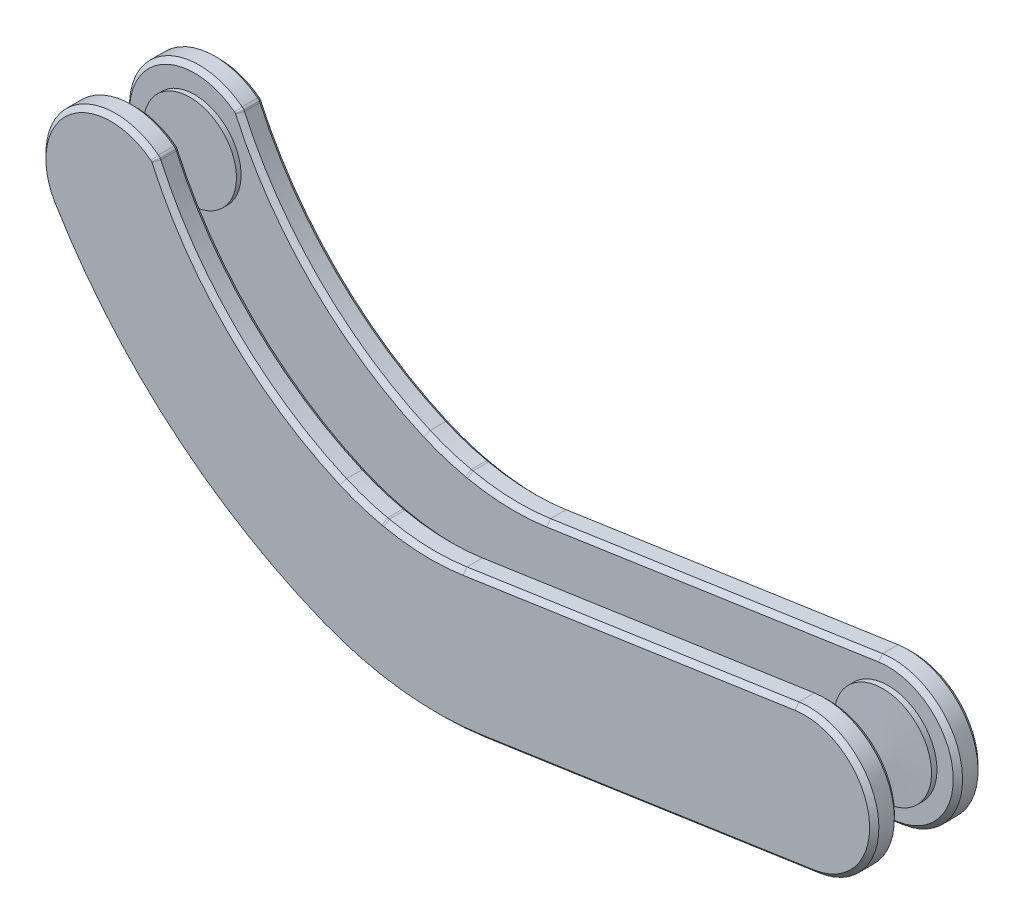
ISO-10303-21;
HEADER;
FILE_DESCRIPTION(('STEP AP214'),'2;1');
FILE_NAME('part.step','',(''),(''),'','','');
FILE_SCHEMA(('AUTOMOTIVE_DESIGN { 1 0 10303 214 1 1 1 1 }'));
ENDSEC;
DATA;
#1=APPLICATION_CONTEXT('core data for automotive mechanical design processes');
#2=APPLICATION_PROTOCOL_DEFINITION('international standard','automotive_design',2000,#1);
#3=PRODUCT_CONTEXT('',#1,'mechanical');
#4=PRODUCT('Part','Part','',(#3));
#5=PRODUCT_RELATED_PRODUCT_CATEGORY('part','',(#4));
#6=PRODUCT_DEFINITION_FORMATION('','',#4);
#7=PRODUCT_DEFINITION_CONTEXT('part definition',#1,'design');
#8=PRODUCT_DEFINITION('design','',#6,#7);
#9=PRODUCT_DEFINITION_SHAPE('','',#8);
#10=(LENGTH_UNIT() NAMED_UNIT(*) SI_UNIT(.MILLI.,.METRE.));
#11=(NAMED_UNIT(*) PLANE_ANGLE_UNIT() SI_UNIT($,.RADIAN.));
#12=(NAMED_UNIT(*) SI_UNIT($,.STERADIAN.) SOLID_ANGLE_UNIT());
#13=UNCERTAINTY_MEASURE_WITH_UNIT(LENGTH_MEASURE(1.E-05),#10,'distance_accuracy_value','');
#14=(GEOMETRIC_REPRESENTATION_CONTEXT(3) GLOBAL_UNCERTAINTY_ASSIGNED_CONTEXT((#13)) GLOBAL_UNIT_ASSIGNED_CONTEXT((#10,
#11,#12)) REPRESENTATION_CONTEXT('',''));
#15=CARTESIAN_POINT('',(0.,0.,0.));
#16=DIRECTION('',(0.,0.,1.));
#17=DIRECTION('',(1.,0.,0.));
#18=AXIS2_PLACEMENT_3D('',#15,#16,#17);
#19=CARTESIAN_POINT('',(247.768962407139,-189.949714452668,-9.49999999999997));
#20=DIRECTION('',(0.,0.,-1.));
#21=DIRECTION('',(0.23449667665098,0.972116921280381,0.));
#22=AXIS2_PLACEMENT_3D('',#19,#20,#21);
#23=PLANE('',#22);
#24=CARTESIAN_POINT('',(145.531994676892,-70.6360300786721,-9.49999999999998));
#25=DIRECTION('',(0.,0.,1.));
#26=DIRECTION('',(0.23449667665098,0.972116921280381,0.));
#27=AXIS2_PLACEMENT_3D('',#24,#25,#26);
#28=CIRCLE('',#27,119.);
#29=CARTESIAN_POINT('',(37.1505899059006,-119.773298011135,-9.49999999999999));
#30=VERTEX_POINT('',#29);
#31=CARTESIAN_POINT('',(97.8638038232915,-179.671545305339,-9.49999999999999));
#32=VERTEX_POINT('',#31);
#33=EDGE_CURVE('P0_E302',#30,#32,#28,.T.);
#34=ORIENTED_EDGE('',*,*,#33,.F.);
#35=CARTESIAN_POINT('',(35.7844377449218,-120.392675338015,-9.49999999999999));
#36=DIRECTION('',(0.,0.,1.));
#37=DIRECTION('',(0.23449667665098,0.972116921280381,0.));
#38=AXIS2_PLACEMENT_3D('',#35,#36,#37);
#39=CIRCLE('',#38,1.49999999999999);
#40=CARTESIAN_POINT('',(37.0802663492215,-119.637143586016,-9.49999999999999));
#41=VERTEX_POINT('',#40);
#42=EDGE_CURVE('P0_E294',#41,#30,#39,.F.);
#43=ORIENTED_EDGE('',*,*,#42,.F.);
#44=CARTESIAN_POINT('',(35.9051852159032,-120.56944414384,-9.49999999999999));
#45=DIRECTION('',(0.,0.,1.));
#46=DIRECTION('',(0.23449667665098,0.972116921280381,0.));
#47=AXIS2_PLACEMENT_3D('',#44,#45,#46);
#48=CIRCLE('',#47,1.49999999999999);
#49=CARTESIAN_POINT('',(36.8270029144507,-119.386121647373,-9.49999999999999));
#50=VERTEX_POINT('',#49);
#51=EDGE_CURVE('P0_E290',#50,#41,#48,.F.);
#52=ORIENTED_EDGE('',*,*,#51,.F.);
#53=CARTESIAN_POINT('',(23.9215551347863,-135.95263659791,-9.49999999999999));
#54=DIRECTION('',(0.,0.,1.));
#55=DIRECTION('',(0.23449667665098,0.972116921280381,0.));
#56=AXIS2_PLACEMENT_3D('',#53,#54,#55);
#57=CIRCLE('',#56,21.);
#58=CARTESIAN_POINT('',(5.91393225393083,-146.756595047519,-9.5));
#59=VERTEX_POINT('',#58);
#60=EDGE_CURVE('P0_E282',#59,#50,#57,.F.);
#61=ORIENTED_EDGE('',*,*,#60,.F.);
#62=CARTESIAN_POINT('',(158.978726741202,-54.9229482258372,-9.49999999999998));
#63=DIRECTION('',(0.,0.,1.));
#64=DIRECTION('',(0.23449667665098,0.972116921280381,0.));
#65=AXIS2_PLACEMENT_3D('',#62,#63,#64);
#66=CIRCLE('',#65,178.5);
#67=CARTESIAN_POINT('',(92.3895837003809,-220.537367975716,-9.49999999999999));
#68=VERTEX_POINT('',#67);
#69=EDGE_CURVE('P0_E254',#68,#59,#66,.F.);
#70=ORIENTED_EDGE('',*,*,#69,.F.);
#71=CARTESIAN_POINT('',(129.134853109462,-129.147898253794,-9.49999999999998));
#72=DIRECTION('',(0.,0.,1.));
#73=DIRECTION('',(0.23449667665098,0.972116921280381,0.));
#74=AXIS2_PLACEMENT_3D('',#71,#72,#73);
#75=CIRCLE('',#74,98.5);
#76=CARTESIAN_POINT('',(143.54201157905,-226.588566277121,-9.49999999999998));
#77=VERTEX_POINT('',#76);
#78=EDGE_CURVE('P0_E255',#77,#68,#75,.F.);
#79=ORIENTED_EDGE('',*,*,#78,.F.);
#80=DIRECTION('',(-0.98924536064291,-0.146265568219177,0.));
#81=VECTOR('',#80,1.);
#82=CARTESIAN_POINT('',(250.840539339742,-210.72386702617,-9.49999999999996));
#83=LINE('',#82,#81);
#84=CARTESIAN_POINT('',(250.840539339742,-210.72386702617,-9.49999999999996));
#85=VERTEX_POINT('',#84);
#86=EDGE_CURVE('P0_E236',#85,#77,#83,.T.);
#87=ORIENTED_EDGE('',*,*,#86,.F.);
#88=CARTESIAN_POINT('',(247.768962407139,-189.949714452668,-9.49999999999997));
#89=DIRECTION('',(0.,0.,1.));
#90=DIRECTION('',(0.23449667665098,0.972116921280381,0.));
#91=AXIS2_PLACEMENT_3D('',#88,#89,#90);
#92=CIRCLE('',#91,21.);
#93=CARTESIAN_POINT('',(244.697385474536,-169.175561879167,-9.49999999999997));
#94=VERTEX_POINT('',#93);
#95=EDGE_CURVE('P0_E247',#94,#85,#92,.F.);
#96=ORIENTED_EDGE('',*,*,#95,.F.);
#97=DIRECTION('',(0.98924536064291,0.146265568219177,0.));
#98=VECTOR('',#97,1.);
#99=CARTESIAN_POINT('',(244.697385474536,-169.175561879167,-9.49999999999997));
#100=LINE('',#99,#98);
#101=CARTESIAN_POINT('',(137.55372377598,-185.017363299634,-9.49999999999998));
#102=VERTEX_POINT('',#101);
#103=EDGE_CURVE('P0_E279',#102,#94,#100,.T.);
#104=ORIENTED_EDGE('',*,*,#103,.F.);
#105=CARTESIAN_POINT('',(127.095735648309,-114.286320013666,-9.49999999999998));
#106=DIRECTION('',(0.,0.,1.));
#107=DIRECTION('',(0.23449667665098,0.972116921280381,0.));
#108=AXIS2_PLACEMENT_3D('',#105,#106,#107);
#109=CIRCLE('',#108,71.5);
#110=CARTESIAN_POINT('',(111.992763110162,-184.173015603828,-9.49999999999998));
#111=VERTEX_POINT('',#110);
#112=EDGE_CURVE('P0_E286',#111,#102,#109,.T.);
#113=ORIENTED_EDGE('',*,*,#112,.F.);
#114=DIRECTION('',(0.977436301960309,-0.211230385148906,0.));
#115=VECTOR('',#114,1.);
#116=CARTESIAN_POINT('',(242.903544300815,-212.463692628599,-9.49999999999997));
#117=LINE('',#116,#115);
#118=CARTESIAN_POINT('',(111.401803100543,-184.045305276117,-9.49999999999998));
#119=VERTEX_POINT('',#118);
#120=EDGE_CURVE('P0_E298',#119,#111,#117,.T.);
#121=ORIENTED_EDGE('',*,*,#120,.F.);
#122=CARTESIAN_POINT('',(126.50477563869,-114.158609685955,-9.49999999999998));
#123=DIRECTION('',(0.,0.,1.));
#124=DIRECTION('',(0.23449667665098,0.972116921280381,0.));
#125=AXIS2_PLACEMENT_3D('',#122,#123,#124);
#126=CIRCLE('',#125,71.5);
#127=EDGE_CURVE('P0_E306',#32,#119,#126,.T.);
#128=ORIENTED_EDGE('',*,*,#127,.F.);
#129=EDGE_LOOP('',(#34,#43,#52,#61,#70,#79,#87,#96,#104,#113,#121,#128));
#130=FACE_BOUND('',#129,.T.);
#131=ADVANCED_FACE('P0_F16',(#130),#23,.F.);
#132=CARTESIAN_POINT('',(145.531994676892,-70.6360300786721,-9.49999999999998));
#133=DIRECTION('',(0.,0.,-1.));
#134=DIRECTION('',(0.23449667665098,0.972116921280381,0.));
#135=AXIS2_PLACEMENT_3D('',#132,#133,#134);
#136=CYLINDRICAL_SURFACE('',#135,117.5);
#137=DIRECTION('',(0.,0.,-1.));
#138=VECTOR('',#137,1.);
#139=CARTESIAN_POINT('',(98.4646633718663,-178.297148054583,-9.49999999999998));
#140=LINE('',#139,#138);
#141=CARTESIAN_POINT('',(98.4646633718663,-178.297148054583,-16.));
#142=VERTEX_POINT('',#141);
#143=CARTESIAN_POINT('',(98.4646633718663,-178.297148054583,-11.));
#144=VERTEX_POINT('',#143);
#145=EDGE_CURVE('P0_E676',#142,#144,#140,.F.);
#146=ORIENTED_EDGE('',*,*,#145,.F.);
#147=CARTESIAN_POINT('',(145.531994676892,-70.6360300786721,-16.));
#148=DIRECTION('',(0.,0.,1.));
#149=DIRECTION('',(0.23449667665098,0.972116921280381,0.));
#150=AXIS2_PLACEMENT_3D('',#147,#148,#149);
#151=CIRCLE('',#150,117.5);
#152=CARTESIAN_POINT('',(38.5167420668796,-119.153920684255,-16.));
#153=VERTEX_POINT('',#152);
#154=EDGE_CURVE('P0_E310',#153,#142,#151,.T.);
#155=ORIENTED_EDGE('',*,*,#154,.F.);
#156=DIRECTION('',(0.,0.,-1.));
#157=VECTOR('',#156,1.);
#158=CARTESIAN_POINT('',(38.5167420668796,-119.153920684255,-9.49999999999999));
#159=LINE('',#158,#157);
#160=CARTESIAN_POINT('',(38.5167420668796,-119.153920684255,-11.));
#161=VERTEX_POINT('',#160);
#162=EDGE_CURVE('P0_E261',#161,#153,#159,.T.);
#163=ORIENTED_EDGE('',*,*,#162,.F.);
#164=CARTESIAN_POINT('',(145.531994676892,-70.6360300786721,-11.));
#165=DIRECTION('',(0.,0.,1.));
#166=DIRECTION('',(0.23449667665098,0.972116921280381,0.));
#167=AXIS2_PLACEMENT_3D('',#164,#165,#166);
#168=CIRCLE('',#167,117.5);
#169=EDGE_CURVE('P0_E314',#144,#161,#168,.F.);
#170=ORIENTED_EDGE('',*,*,#169,.F.);
#171=EDGE_LOOP('',(#146,#155,#163,#170));
#172=FACE_BOUND('',#171,.T.);
#173=ADVANCED_FACE('P0_F506',(#172),#136,.F.);
#174=CARTESIAN_POINT('',(23.9215551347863,-135.95263659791,-9.49999999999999));
#175=DIRECTION('',(0.,0.,-1.));
#176=DIRECTION('',(0.23449667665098,0.972116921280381,0.));
#177=AXIS2_PLACEMENT_3D('',#174,#175,#176);
#178=CYLINDRICAL_SURFACE('',#177,22.5);
#179=DIRECTION('',(0.,0.,-1.));
#180=VECTOR('',#179,1.);
#181=CARTESIAN_POINT('',(37.7488206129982,-118.202799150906,-9.49999999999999));
#182=LINE('',#181,#180);
#183=CARTESIAN_POINT('',(37.7488206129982,-118.202799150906,-16.));
#184=VERTEX_POINT('',#183);
#185=CARTESIAN_POINT('',(37.7488206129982,-118.202799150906,-11.));
#186=VERTEX_POINT('',#185);
#187=EDGE_CURVE('P0_E271',#184,#186,#182,.F.);
#188=ORIENTED_EDGE('',*,*,#187,.F.);
#189=CARTESIAN_POINT('',(23.9215551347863,-135.95263659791,-16.));
#190=DIRECTION('',(0.,0.,1.));
#191=DIRECTION('',(0.23449667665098,0.972116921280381,0.));
#192=AXIS2_PLACEMENT_3D('',#189,#190,#191);
#193=CIRCLE('',#192,22.5);
#194=CARTESIAN_POINT('',(4.62767347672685,-147.528306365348,-16.));
#195=VERTEX_POINT('',#194);
#196=EDGE_CURVE('P0_E405',#195,#184,#193,.F.);
#197=ORIENTED_EDGE('',*,*,#196,.F.);
#198=DIRECTION('',(0.,0.,-1.));
#199=VECTOR('',#198,1.);
#200=CARTESIAN_POINT('',(4.62767347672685,-147.528306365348,-9.5));
#201=LINE('',#200,#199);
#202=CARTESIAN_POINT('',(4.62767347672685,-147.528306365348,-11.));
#203=VERTEX_POINT('',#202);
#204=EDGE_CURVE('P0_E1224',#203,#195,#201,.T.);
#205=ORIENTED_EDGE('',*,*,#204,.F.);
#206=CARTESIAN_POINT('',(23.9215551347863,-135.95263659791,-11.));
#207=DIRECTION('',(0.,0.,1.));
#208=DIRECTION('',(0.23449667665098,0.972116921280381,0.));
#209=AXIS2_PLACEMENT_3D('',#206,#207,#208);
#210=CIRCLE('',#209,22.5);
#211=EDGE_CURVE('P0_E409',#186,#203,#210,.T.);
#212=ORIENTED_EDGE('',*,*,#211,.F.);
#213=EDGE_LOOP('',(#188,#197,#205,#212));
#214=FACE_BOUND('',#213,.T.);
#215=ADVANCED_FACE('P0_F509',(#214),#178,.T.);
#216=CARTESIAN_POINT('',(158.978726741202,-54.9229482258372,-9.49999999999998));
#217=DIRECTION('',(0.,0.,-1.));
#218=DIRECTION('',(0.23449667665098,0.972116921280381,0.));
#219=AXIS2_PLACEMENT_3D('',#216,#217,#218);
#220=CYLINDRICAL_SURFACE('',#219,180.);
#221=ORIENTED_EDGE('',*,*,#204,.T.);
#222=CARTESIAN_POINT('',(158.978726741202,-54.9229482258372,-16.));
#223=DIRECTION('',(0.,0.,1.));
#224=DIRECTION('',(0.23449667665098,0.972116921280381,0.));
#225=AXIS2_PLACEMENT_3D('',#222,#223,#224);
#226=CIRCLE('',#225,180.);
#227=CARTESIAN_POINT('',(91.8300110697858,-221.92908578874,-16.));
#228=VERTEX_POINT('',#227);
#229=EDGE_CURVE('P0_E421',#228,#195,#226,.F.);
#230=ORIENTED_EDGE('',*,*,#229,.F.);
#231=DIRECTION('',(0.,0.,-1.));
#232=VECTOR('',#231,1.);
#233=CARTESIAN_POINT('',(91.8300110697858,-221.92908578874,-9.49999999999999));
#234=LINE('',#233,#232);
#235=CARTESIAN_POINT('',(91.8300110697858,-221.92908578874,-11.));
#236=VERTEX_POINT('',#235);
#237=EDGE_CURVE('P0_E1226',#236,#228,#234,.T.);
#238=ORIENTED_EDGE('',*,*,#237,.F.);
#239=CARTESIAN_POINT('',(158.978726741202,-54.9229482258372,-11.));
#240=DIRECTION('',(0.,0.,1.));
#241=DIRECTION('',(0.23449667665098,0.972116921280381,0.));
#242=AXIS2_PLACEMENT_3D('',#239,#240,#241);
#243=CIRCLE('',#242,180.);
#244=EDGE_CURVE('P0_E425',#203,#236,#243,.T.);
#245=ORIENTED_EDGE('',*,*,#244,.F.);
#246=EDGE_LOOP('',(#221,#230,#238,#245));
#247=FACE_BOUND('',#246,.T.);
#248=ADVANCED_FACE('P0_F526',(#247),#220,.T.);
#249=CARTESIAN_POINT('',(251.05993769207,-212.207735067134,-9.49999999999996));
#250=DIRECTION('',(-0.146265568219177,0.98924536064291,0.));
#251=DIRECTION('',(-0.98924536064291,-0.146265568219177,0.));
#252=AXIS2_PLACEMENT_3D('',#249,#250,#251);
#253=PLANE('',#252);
#254=DIRECTION('',(0.,0.,1.));
#255=VECTOR('',#254,1.);
#256=CARTESIAN_POINT('',(143.761409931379,-228.072434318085,-9.49999999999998));
#257=LINE('',#256,#255);
#258=CARTESIAN_POINT('',(143.761409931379,-228.072434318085,-16.));
#259=VERTEX_POINT('',#258);
#260=CARTESIAN_POINT('',(143.761409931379,-228.072434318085,-11.));
#261=VERTEX_POINT('',#260);
#262=EDGE_CURVE('P0_E873',#259,#261,#257,.T.);
#263=ORIENTED_EDGE('',*,*,#262,.F.);
#264=DIRECTION('',(-0.98924536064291,-0.146265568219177,0.));
#265=VECTOR('',#264,1.);
#266=CARTESIAN_POINT('',(143.761409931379,-228.072434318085,-16.));
#267=LINE('',#266,#265);
#268=CARTESIAN_POINT('',(251.05993769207,-212.207735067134,-16.));
#269=VERTEX_POINT('',#268);
#270=EDGE_CURVE('P0_E26',#269,#259,#267,.T.);
#271=ORIENTED_EDGE('',*,*,#270,.F.);
#272=DIRECTION('',(0.,0.,-1.));
#273=VECTOR('',#272,1.);
#274=CARTESIAN_POINT('',(251.05993769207,-212.207735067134,-9.49999999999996));
#275=LINE('',#274,#273);
#276=CARTESIAN_POINT('',(251.05993769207,-212.207735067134,-11.));
#277=VERTEX_POINT('',#276);
#278=EDGE_CURVE('P0_E744',#277,#269,#275,.T.);
#279=ORIENTED_EDGE('',*,*,#278,.F.);
#280=DIRECTION('',(0.98924536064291,0.146265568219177,0.));
#281=VECTOR('',#280,1.);
#282=CARTESIAN_POINT('',(251.05993769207,-212.207735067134,-11.));
#283=LINE('',#282,#281);
#284=EDGE_CURVE('P0_E11',#261,#277,#283,.T.);
#285=ORIENTED_EDGE('',*,*,#284,.F.);
#286=EDGE_LOOP('',(#263,#271,#279,#285));
#287=FACE_BOUND('',#286,.T.);
#288=ADVANCED_FACE('P0_F522',(#287),#253,.F.);
#289=CARTESIAN_POINT('',(247.768962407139,-189.949714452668,-9.49999999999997));
#290=DIRECTION('',(0.,0.,-1.));
#291=DIRECTION('',(0.23449667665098,0.972116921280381,0.));
#292=AXIS2_PLACEMENT_3D('',#289,#290,#291);
#293=CYLINDRICAL_SURFACE('',#292,22.5);
#294=ORIENTED_EDGE('',*,*,#278,.T.);
#295=CARTESIAN_POINT('',(247.768962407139,-189.949714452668,-16.));
#296=DIRECTION('',(0.,0.,1.));
#297=DIRECTION('',(0.23449667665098,0.972116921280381,0.));
#298=AXIS2_PLACEMENT_3D('',#295,#296,#297);
#299=CIRCLE('',#298,22.5);
#300=CARTESIAN_POINT('',(244.477987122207,-167.691693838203,-16.));
#301=VERTEX_POINT('',#300);
#302=EDGE_CURVE('P0_E429',#301,#269,#299,.F.);
#303=ORIENTED_EDGE('',*,*,#302,.F.);
#304=DIRECTION('',(0.,0.,-1.));
#305=VECTOR('',#304,1.);
#306=CARTESIAN_POINT('',(244.477987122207,-167.691693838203,-9.49999999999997));
#307=LINE('',#306,#305);
#308=CARTESIAN_POINT('',(244.477987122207,-167.691693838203,-11.));
#309=VERTEX_POINT('',#308);
#310=EDGE_CURVE('P0_E740',#309,#301,#307,.T.);
#311=ORIENTED_EDGE('',*,*,#310,.F.);
#312=CARTESIAN_POINT('',(247.768962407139,-189.949714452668,-11.));
#313=DIRECTION('',(0.,0.,1.));
#314=DIRECTION('',(0.23449667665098,0.972116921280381,0.));
#315=AXIS2_PLACEMENT_3D('',#312,#313,#314);
#316=CIRCLE('',#315,22.5);
#317=EDGE_CURVE('P0_E433',#277,#309,#316,.T.);
#318=ORIENTED_EDGE('',*,*,#317,.F.);
#319=EDGE_LOOP('',(#294,#303,#311,#318));
#320=FACE_BOUND('',#319,.T.);
#321=ADVANCED_FACE('P0_F518',(#320),#293,.T.);
#322=CARTESIAN_POINT('',(244.477987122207,-167.691693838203,-9.49999999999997));
#323=DIRECTION('',(-0.146265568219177,0.98924536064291,0.));
#324=DIRECTION('',(-0.98924536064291,-0.146265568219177,0.));
#325=AXIS2_PLACEMENT_3D('',#322,#323,#324);
#326=PLANE('',#325);
#327=ORIENTED_EDGE('',*,*,#310,.T.);
#328=DIRECTION('',(0.98924536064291,0.146265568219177,0.));
#329=VECTOR('',#328,1.);
#330=CARTESIAN_POINT('',(244.477987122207,-167.691693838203,-16.));
#331=LINE('',#330,#329);
#332=CARTESIAN_POINT('',(137.334325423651,-183.533495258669,-16.));
#333=VERTEX_POINT('',#332);
#334=EDGE_CURVE('P0_E413',#333,#301,#331,.T.);
#335=ORIENTED_EDGE('',*,*,#334,.F.);
#336=DIRECTION('',(0.,0.,-1.));
#337=VECTOR('',#336,1.);
#338=CARTESIAN_POINT('',(137.334325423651,-183.533495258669,-9.49999999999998));
#339=LINE('',#338,#337);
#340=CARTESIAN_POINT('',(137.334325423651,-183.533495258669,-11.));
#341=VERTEX_POINT('',#340);
#342=EDGE_CURVE('P0_E673',#341,#333,#339,.T.);
#343=ORIENTED_EDGE('',*,*,#342,.F.);
#344=DIRECTION('',(-0.98924536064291,-0.146265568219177,0.));
#345=VECTOR('',#344,1.);
#346=CARTESIAN_POINT('',(137.334325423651,-183.533495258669,-11.));
#347=LINE('',#346,#345);
#348=EDGE_CURVE('P0_E417',#309,#341,#347,.T.);
#349=ORIENTED_EDGE('',*,*,#348,.F.);
#350=EDGE_LOOP('',(#327,#335,#343,#349));
#351=FACE_BOUND('',#350,.T.);
#352=ADVANCED_FACE('P0_F514',(#351),#326,.T.);
#353=CARTESIAN_POINT('',(243.220389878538,-210.997538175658,-9.49999999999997));
#354=DIRECTION('',(-0.211230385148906,-0.977436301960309,0.));
#355=DIRECTION('',(0.977436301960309,-0.211230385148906,0.));
#356=AXIS2_PLACEMENT_3D('',#353,#354,#355);
#357=PLANE('',#356);
#358=DIRECTION('',(0.,0.,-1.));
#359=VECTOR('',#358,1.);
#360=CARTESIAN_POINT('',(112.309608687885,-182.706861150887,-9.49999999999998));
#361=LINE('',#360,#359);
#362=CARTESIAN_POINT('',(112.309608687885,-182.706861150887,-16.));
#363=VERTEX_POINT('',#362);
#364=CARTESIAN_POINT('',(112.309608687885,-182.706861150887,-11.));
#365=VERTEX_POINT('',#364);
#366=EDGE_CURVE('P0_E868',#363,#365,#361,.F.);
#367=ORIENTED_EDGE('',*,*,#366,.F.);
#368=DIRECTION('',(0.977436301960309,-0.211230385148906,0.));
#369=VECTOR('',#368,1.);
#370=CARTESIAN_POINT('',(112.309608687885,-182.706861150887,-16.));
#371=LINE('',#370,#369);
#372=CARTESIAN_POINT('',(111.718648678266,-182.579150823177,-16.));
#373=VERTEX_POINT('',#372);
#374=EDGE_CURVE('P0_E318',#373,#363,#371,.T.);
#375=ORIENTED_EDGE('',*,*,#374,.F.);
#376=DIRECTION('',(0.,0.,1.));
#377=VECTOR('',#376,1.);
#378=CARTESIAN_POINT('',(111.718648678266,-182.579150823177,-17.5));
#379=LINE('',#378,#377);
#380=CARTESIAN_POINT('',(111.718648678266,-182.579150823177,-11.));
#381=VERTEX_POINT('',#380);
#382=EDGE_CURVE('P0_E698',#381,#373,#379,.F.);
#383=ORIENTED_EDGE('',*,*,#382,.F.);
#384=DIRECTION('',(-0.977436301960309,0.211230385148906,0.));
#385=VECTOR('',#384,1.);
#386=CARTESIAN_POINT('',(243.220389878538,-210.997538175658,-10.9999999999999));
#387=LINE('',#386,#385);
#388=EDGE_CURVE('P0_E322',#365,#381,#387,.T.);
#389=ORIENTED_EDGE('',*,*,#388,.F.);
#390=EDGE_LOOP('',(#367,#375,#383,#389));
#391=FACE_BOUND('',#390,.T.);
#392=ADVANCED_FACE('P0_F511',(#391),#357,.F.);
#393=CARTESIAN_POINT('',(158.978726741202,-54.9229482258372,-17.5));
#394=DIRECTION('',(0.,0.,-1.));
#395=DIRECTION('',(0.23449667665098,0.972116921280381,0.));
#396=AXIS2_PLACEMENT_3D('',#393,#394,#395);
#397=PLANE('',#396);
#398=DIRECTION('',(-0.977436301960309,0.211230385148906,0.));
#399=VECTOR('',#398,1.);
#400=CARTESIAN_POINT('',(111.401803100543,-184.045305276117,-17.5));
#401=LINE('',#400,#399);
#402=CARTESIAN_POINT('',(111.992763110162,-184.173015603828,-17.5));
#403=VERTEX_POINT('',#402);
#404=CARTESIAN_POINT('',(111.401803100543,-184.045305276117,-17.5));
#405=VERTEX_POINT('',#404);
#406=EDGE_CURVE('P0_E361',#403,#405,#401,.T.);
#407=ORIENTED_EDGE('',*,*,#406,.F.);
#408=CARTESIAN_POINT('',(127.095735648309,-114.286320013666,-17.5));
#409=DIRECTION('',(0.,0.,1.));
#410=DIRECTION('',(0.23449667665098,0.972116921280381,0.));
#411=AXIS2_PLACEMENT_3D('',#408,#409,#410);
#412=CIRCLE('',#411,71.5);
#413=CARTESIAN_POINT('',(137.55372377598,-185.017363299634,-17.5));
#414=VERTEX_POINT('',#413);
#415=EDGE_CURVE('P0_E349',#414,#403,#412,.F.);
#416=ORIENTED_EDGE('',*,*,#415,.F.);
#417=DIRECTION('',(-0.98924536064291,-0.146265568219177,0.));
#418=VECTOR('',#417,1.);
#419=CARTESIAN_POINT('',(177.344059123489,-179.134135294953,-17.5));
#420=LINE('',#419,#418);
#421=CARTESIAN_POINT('',(244.697385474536,-169.175561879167,-17.5));
#422=VERTEX_POINT('',#421);
#423=EDGE_CURVE('P0_E326',#422,#414,#420,.T.);
#424=ORIENTED_EDGE('',*,*,#423,.F.);
#425=CARTESIAN_POINT('',(247.768962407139,-189.949714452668,-17.5));
#426=DIRECTION('',(0.,0.,1.));
#427=DIRECTION('',(0.23449667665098,0.972116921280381,0.));
#428=AXIS2_PLACEMENT_3D('',#425,#426,#427);
#429=CIRCLE('',#428,21.);
#430=CARTESIAN_POINT('',(250.840539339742,-210.72386702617,-17.5));
#431=VERTEX_POINT('',#430);
#432=EDGE_CURVE('P0_E330',#431,#422,#429,.T.);
#433=ORIENTED_EDGE('',*,*,#432,.F.);
#434=DIRECTION('',(0.98924536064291,0.146265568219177,0.));
#435=VECTOR('',#434,1.);
#436=CARTESIAN_POINT('',(250.840539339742,-210.72386702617,-17.5));
#437=LINE('',#436,#435);
#438=CARTESIAN_POINT('',(143.54201157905,-226.588566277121,-17.5));
#439=VERTEX_POINT('',#438);
#440=EDGE_CURVE('P0_E334',#439,#431,#437,.T.);
#441=ORIENTED_EDGE('',*,*,#440,.F.);
#442=CARTESIAN_POINT('',(129.134853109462,-129.147898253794,-17.5));
#443=DIRECTION('',(0.,0.,1.));
#444=DIRECTION('',(0.23449667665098,0.972116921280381,0.));
#445=AXIS2_PLACEMENT_3D('',#442,#443,#444);
#446=CIRCLE('',#445,98.5);
#447=CARTESIAN_POINT('',(92.3895837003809,-220.537367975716,-17.5));
#448=VERTEX_POINT('',#447);
#449=EDGE_CURVE('P0_E338',#448,#439,#446,.T.);
#450=ORIENTED_EDGE('',*,*,#449,.F.);
#451=CARTESIAN_POINT('',(158.978726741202,-54.9229482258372,-17.5));
#452=DIRECTION('',(0.,0.,1.));
#453=DIRECTION('',(0.23449667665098,0.972116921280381,0.));
#454=AXIS2_PLACEMENT_3D('',#451,#452,#453);
#455=CIRCLE('',#454,178.5);
#456=CARTESIAN_POINT('',(5.9139322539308,-146.756595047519,-17.5));
#457=VERTEX_POINT('',#456);
#458=EDGE_CURVE('P0_E341',#457,#448,#455,.T.);
#459=ORIENTED_EDGE('',*,*,#458,.F.);
#460=CARTESIAN_POINT('',(23.9215551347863,-135.95263659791,-17.5));
#461=DIRECTION('',(0.,0.,1.));
#462=DIRECTION('',(0.23449667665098,0.972116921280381,0.));
#463=AXIS2_PLACEMENT_3D('',#460,#461,#462);
#464=CIRCLE('',#463,21.);
#465=CARTESIAN_POINT('',(36.8270029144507,-119.386121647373,-17.5));
#466=VERTEX_POINT('',#465);
#467=EDGE_CURVE('P0_E345',#466,#457,#464,.T.);
#468=ORIENTED_EDGE('',*,*,#467,.F.);
#469=CARTESIAN_POINT('',(35.9051852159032,-120.56944414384,-17.5));
#470=DIRECTION('',(0.,0.,1.));
#471=DIRECTION('',(0.23449667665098,0.972116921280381,0.));
#472=AXIS2_PLACEMENT_3D('',#469,#470,#471);
#473=CIRCLE('',#472,1.49999999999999);
#474=CARTESIAN_POINT('',(37.0802663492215,-119.637143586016,-17.5));
#475=VERTEX_POINT('',#474);
#476=EDGE_CURVE('P0_E353',#475,#466,#473,.T.);
#477=ORIENTED_EDGE('',*,*,#476,.F.);
#478=CARTESIAN_POINT('',(35.7844377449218,-120.392675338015,-17.5));
#479=DIRECTION('',(0.,0.,1.));
#480=DIRECTION('',(0.23449667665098,0.972116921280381,0.));
#481=AXIS2_PLACEMENT_3D('',#478,#479,#480);
#482=CIRCLE('',#481,1.49999999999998);
#483=CARTESIAN_POINT('',(37.1505899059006,-119.773298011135,-17.5));
#484=VERTEX_POINT('',#483);
#485=EDGE_CURVE('P0_E357',#484,#475,#482,.T.);
#486=ORIENTED_EDGE('',*,*,#485,.F.);
#487=CARTESIAN_POINT('',(145.531994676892,-70.6360300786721,-17.5));
#488=DIRECTION('',(0.,0.,1.));
#489=DIRECTION('',(0.23449667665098,0.972116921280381,0.));
#490=AXIS2_PLACEMENT_3D('',#487,#488,#489);
#491=CIRCLE('',#490,119.);
#492=CARTESIAN_POINT('',(97.8638038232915,-179.671545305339,-17.5));
#493=VERTEX_POINT('',#492);
#494=EDGE_CURVE('P0_E365',#493,#484,#491,.F.);
#495=ORIENTED_EDGE('',*,*,#494,.F.);
#496=CARTESIAN_POINT('',(126.50477563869,-114.158609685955,-17.5));
#497=DIRECTION('',(0.,0.,1.));
#498=DIRECTION('',(0.23449667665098,0.972116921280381,0.));
#499=AXIS2_PLACEMENT_3D('',#496,#497,#498);
#500=CIRCLE('',#499,71.5);
#501=EDGE_CURVE('P0_E369',#405,#493,#500,.F.);
#502=ORIENTED_EDGE('',*,*,#501,.F.);
#503=EDGE_LOOP('',(#407,#416,#424,#433,#441,#450,#459,#468,#477,#486,#495,#502));
#504=FACE_BOUND('',#503,.T.);
#505=ADVANCED_FACE('P0_F502',(#504),#397,.T.);
#506=CARTESIAN_POINT('',(129.134853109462,-129.147898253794,-9.49999999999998));
#507=DIRECTION('',(0.,0.,-1.));
#508=DIRECTION('',(0.23449667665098,0.972116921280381,0.));
#509=AXIS2_PLACEMENT_3D('',#506,#507,#508);
#510=CYLINDRICAL_SURFACE('',#509,100.);
#511=ORIENTED_EDGE('',*,*,#237,.T.);
#512=CARTESIAN_POINT('',(129.134853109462,-129.147898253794,-16.));
#513=DIRECTION('',(0.,0.,1.));
#514=DIRECTION('',(0.23449667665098,0.972116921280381,0.));
#515=AXIS2_PLACEMENT_3D('',#512,#513,#514);
#516=CIRCLE('',#515,100.);
#517=EDGE_CURVE('P0_E436',#259,#228,#516,.F.);
#518=ORIENTED_EDGE('',*,*,#517,.F.);
#519=ORIENTED_EDGE('',*,*,#262,.T.);
#520=CARTESIAN_POINT('',(129.134853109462,-129.147898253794,-11.));
#521=DIRECTION('',(0.,0.,1.));
#522=DIRECTION('',(0.23449667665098,0.972116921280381,0.));
#523=AXIS2_PLACEMENT_3D('',#520,#521,#522);
#524=CIRCLE('',#523,100.);
#525=EDGE_CURVE('P0_E439',#236,#261,#524,.T.);
#526=ORIENTED_EDGE('',*,*,#525,.F.);
#527=EDGE_LOOP('',(#511,#518,#519,#526));
#528=FACE_BOUND('',#527,.T.);
#529=ADVANCED_FACE('P0_F498',(#528),#510,.T.);
#530=CARTESIAN_POINT('',(126.50477563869,-114.158609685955,-9.49999999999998));
#531=DIRECTION('',(0.,0.,-1.));
#532=DIRECTION('',(0.23449667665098,0.972116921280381,0.));
#533=AXIS2_PLACEMENT_3D('',#530,#531,#532);
#534=CYLINDRICAL_SURFACE('',#533,70.);
#535=ORIENTED_EDGE('',*,*,#382,.T.);
#536=CARTESIAN_POINT('',(126.50477563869,-114.158609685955,-16.));
#537=DIRECTION('',(0.,0.,1.));
#538=DIRECTION('',(0.23449667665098,0.972116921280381,0.));
#539=AXIS2_PLACEMENT_3D('',#536,#537,#538);
#540=CIRCLE('',#539,70.);
#541=EDGE_CURVE('P0_E381',#142,#373,#540,.T.);
#542=ORIENTED_EDGE('',*,*,#541,.F.);
#543=ORIENTED_EDGE('',*,*,#145,.T.);
#544=CARTESIAN_POINT('',(126.50477563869,-114.158609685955,-11.));
#545=DIRECTION('',(0.,0.,1.));
#546=DIRECTION('',(0.23449667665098,0.972116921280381,0.));
#547=AXIS2_PLACEMENT_3D('',#544,#545,#546);
#548=CIRCLE('',#547,70.);
#549=EDGE_CURVE('P0_E385',#381,#144,#548,.F.);
#550=ORIENTED_EDGE('',*,*,#549,.F.);
#551=EDGE_LOOP('',(#535,#542,#543,#550));
#552=FACE_BOUND('',#551,.T.);
#553=ADVANCED_FACE('P0_F494',(#552),#534,.F.);
#554=CARTESIAN_POINT('',(127.095735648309,-114.286320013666,-9.49999999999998));
#555=DIRECTION('',(0.,0.,-1.));
#556=DIRECTION('',(0.23449667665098,0.972116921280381,0.));
#557=AXIS2_PLACEMENT_3D('',#554,#555,#556);
#558=CYLINDRICAL_SURFACE('',#557,70.);
#559=ORIENTED_EDGE('',*,*,#342,.T.);
#560=CARTESIAN_POINT('',(127.095735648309,-114.286320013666,-16.));
#561=DIRECTION('',(0.,0.,1.));
#562=DIRECTION('',(0.23449667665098,0.972116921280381,0.));
#563=AXIS2_PLACEMENT_3D('',#560,#561,#562);
#564=CIRCLE('',#563,70.);
#565=EDGE_CURVE('P0_E397',#363,#333,#564,.T.);
#566=ORIENTED_EDGE('',*,*,#565,.F.);
#567=ORIENTED_EDGE('',*,*,#366,.T.);
#568=CARTESIAN_POINT('',(127.095735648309,-114.286320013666,-11.));
#569=DIRECTION('',(0.,0.,1.));
#570=DIRECTION('',(0.23449667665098,0.972116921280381,0.));
#571=AXIS2_PLACEMENT_3D('',#568,#569,#570);
#572=CIRCLE('',#571,70.);
#573=EDGE_CURVE('P0_E401',#341,#365,#572,.F.);
#574=ORIENTED_EDGE('',*,*,#573,.F.);
#575=EDGE_LOOP('',(#559,#566,#567,#574));
#576=FACE_BOUND('',#575,.T.);
#577=ADVANCED_FACE('P0_F487',(#576),#558,.F.);
#578=CARTESIAN_POINT('',(35.7844377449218,-120.392675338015,-9.49999999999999));
#579=DIRECTION('',(0.,0.,-1.));
#580=DIRECTION('',(0.23449667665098,0.972116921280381,0.));
#581=AXIS2_PLACEMENT_3D('',#578,#579,#580);
#582=CYLINDRICAL_SURFACE('',#581,3.);
#583=ORIENTED_EDGE('',*,*,#162,.T.);
#584=CARTESIAN_POINT('',(35.7844377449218,-120.392675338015,-16.));
#585=DIRECTION('',(0.,0.,1.));
#586=DIRECTION('',(0.23449667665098,0.972116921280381,0.));
#587=AXIS2_PLACEMENT_3D('',#584,#585,#586);
#588=CIRCLE('',#587,3.);
#589=CARTESIAN_POINT('',(38.3204589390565,-118.789991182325,-16.));
#590=VERTEX_POINT('',#589);
#591=EDGE_CURVE('P0_E373',#590,#153,#588,.F.);
#592=ORIENTED_EDGE('',*,*,#591,.F.);
#593=DIRECTION('',(0.,0.,-1.));
#594=VECTOR('',#593,1.);
#595=CARTESIAN_POINT('',(38.3204589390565,-118.789991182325,-13.5));
#596=LINE('',#595,#594);
#597=CARTESIAN_POINT('',(38.3204589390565,-118.789991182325,-11.));
#598=VERTEX_POINT('',#597);
#599=EDGE_CURVE('P0_E274',#590,#598,#596,.F.);
#600=ORIENTED_EDGE('',*,*,#599,.T.);
#601=CARTESIAN_POINT('',(35.7844377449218,-120.392675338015,-11.));
#602=DIRECTION('',(0.,0.,1.));
#603=DIRECTION('',(0.23449667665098,0.972116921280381,0.));
#604=AXIS2_PLACEMENT_3D('',#601,#602,#603);
#605=CIRCLE('',#604,3.);
#606=EDGE_CURVE('P0_E377',#161,#598,#605,.T.);
#607=ORIENTED_EDGE('',*,*,#606,.F.);
#608=EDGE_LOOP('',(#583,#592,#600,#607));
#609=FACE_BOUND('',#608,.T.);
#610=ADVANCED_FACE('P0_F483',(#609),#582,.T.);
#611=CARTESIAN_POINT('',(35.9051852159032,-120.56944414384,-9.49999999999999));
#612=DIRECTION('',(0.,0.,1.));
#613=DIRECTION('',(-0.23449667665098,-0.972116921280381,0.));
#614=AXIS2_PLACEMENT_3D('',#611,#612,#613);
#615=CYLINDRICAL_SURFACE('',#614,3.);
#616=ORIENTED_EDGE('',*,*,#599,.F.);
#617=CARTESIAN_POINT('',(35.9051852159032,-120.56944414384,-16.));
#618=DIRECTION('',(0.,0.,1.));
#619=DIRECTION('',(0.23449667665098,0.972116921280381,0.));
#620=AXIS2_PLACEMENT_3D('',#617,#618,#619);
#621=CIRCLE('',#620,3.);
#622=EDGE_CURVE('P0_E389',#184,#590,#621,.F.);
#623=ORIENTED_EDGE('',*,*,#622,.F.);
#624=ORIENTED_EDGE('',*,*,#187,.T.);
#625=CARTESIAN_POINT('',(35.9051852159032,-120.56944414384,-11.));
#626=DIRECTION('',(0.,0.,1.));
#627=DIRECTION('',(0.23449667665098,0.972116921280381,0.));
#628=AXIS2_PLACEMENT_3D('',#625,#626,#627);
#629=CIRCLE('',#628,3.);
#630=EDGE_CURVE('P0_E393',#598,#186,#629,.T.);
#631=ORIENTED_EDGE('',*,*,#630,.F.);
#632=EDGE_LOOP('',(#616,#623,#624,#631));
#633=FACE_BOUND('',#632,.T.);
#634=ADVANCED_FACE('P0_F486',(#633),#615,.T.);
#635=CARTESIAN_POINT('',(250.840539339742,-210.72386702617,-9.49999999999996));
#636=DIRECTION('',(-0.103425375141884,0.699502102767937,-0.707106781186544));
#637=DIRECTION('',(-0.98924536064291,-0.146265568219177,0.));
#638=AXIS2_PLACEMENT_3D('',#635,#636,#637);
#639=PLANE('',#638);
#640=DIRECTION('',(-0.103425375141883,0.69950210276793,0.707106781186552));
#641=VECTOR('',#640,1.);
#642=CARTESIAN_POINT('',(251.05993769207,-212.207735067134,-11.));
#643=LINE('',#642,#641);
#644=EDGE_CURVE('P0_E232',#277,#85,#643,.T.);
#645=ORIENTED_EDGE('',*,*,#644,.T.);
#646=ORIENTED_EDGE('',*,*,#86,.T.);
#647=DIRECTION('',(0.103425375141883,-0.699502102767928,-0.707106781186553));
#648=VECTOR('',#647,1.);
#649=CARTESIAN_POINT('',(143.54201157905,-226.588566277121,-9.49999999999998));
#650=LINE('',#649,#648);
#651=EDGE_CURVE('P0_E38',#77,#261,#650,.T.);
#652=ORIENTED_EDGE('',*,*,#651,.T.);
#653=ORIENTED_EDGE('',*,*,#284,.T.);
#654=EDGE_LOOP('',(#645,#646,#652,#653));
#655=FACE_BOUND('',#654,.T.);
#656=ADVANCED_FACE('P0_F234',(#655),#639,.F.);
#657=CARTESIAN_POINT('',(129.134853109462,-129.147898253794,-9.49999999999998));
#658=DIRECTION('',(0.,0.,-1.));
#659=DIRECTION('',(0.23449667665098,0.972116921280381,0.));
#660=AXIS2_PLACEMENT_3D('',#657,#658,#659);
#661=CONICAL_SURFACE('',#660,98.5,0.785398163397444);
#662=ORIENTED_EDGE('',*,*,#651,.F.);
#663=ORIENTED_EDGE('',*,*,#78,.T.);
#664=DIRECTION('',(-0.263785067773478,-0.656062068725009,-0.70710678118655));
#665=VECTOR('',#664,1.);
#666=CARTESIAN_POINT('',(92.3895837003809,-220.537367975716,-9.49999999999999));
#667=LINE('',#666,#665);
#668=EDGE_CURVE('P0_E244',#68,#236,#667,.T.);
#669=ORIENTED_EDGE('',*,*,#668,.T.);
#670=ORIENTED_EDGE('',*,*,#525,.T.);
#671=EDGE_LOOP('',(#662,#663,#669,#670));
#672=FACE_BOUND('',#671,.T.);
#673=ADVANCED_FACE('P0_F818',(#672),#661,.T.);
#674=CARTESIAN_POINT('',(247.768962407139,-189.949714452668,-11.));
#675=DIRECTION('',(0.,0.,-1.));
#676=DIRECTION('',(0.23449667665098,0.972116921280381,0.));
#677=AXIS2_PLACEMENT_3D('',#674,#675,#676);
#678=CONICAL_SURFACE('',#677,22.5,0.785398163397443);
#679=ORIENTED_EDGE('',*,*,#644,.F.);
#680=ORIENTED_EDGE('',*,*,#317,.T.);
#681=DIRECTION('',(0.103425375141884,-0.69950210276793,0.707106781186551));
#682=VECTOR('',#681,1.);
#683=CARTESIAN_POINT('',(244.477987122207,-167.691693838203,-11.));
#684=LINE('',#683,#682);
#685=EDGE_CURVE('P0_E249',#309,#94,#684,.T.);
#686=ORIENTED_EDGE('',*,*,#685,.T.);
#687=ORIENTED_EDGE('',*,*,#95,.T.);
#688=EDGE_LOOP('',(#679,#680,#686,#687));
#689=FACE_BOUND('',#688,.T.);
#690=ADVANCED_FACE('P0_F248',(#689),#678,.T.);
#691=CARTESIAN_POINT('',(158.978726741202,-54.9229482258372,-11.));
#692=DIRECTION('',(0.,0.,-1.));
#693=DIRECTION('',(0.23449667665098,0.972116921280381,0.));
#694=AXIS2_PLACEMENT_3D('',#691,#692,#693);
#695=CONICAL_SURFACE('',#694,180.,0.785398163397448);
#696=ORIENTED_EDGE('',*,*,#668,.F.);
#697=ORIENTED_EDGE('',*,*,#69,.T.);
#698=DIRECTION('',(-0.606348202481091,-0.363788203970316,-0.707106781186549));
#699=VECTOR('',#698,1.);
#700=CARTESIAN_POINT('',(5.91393225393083,-146.756595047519,-9.5));
#701=LINE('',#700,#699);
#702=EDGE_CURVE('P0_E777',#59,#203,#701,.T.);
#703=ORIENTED_EDGE('',*,*,#702,.T.);
#704=ORIENTED_EDGE('',*,*,#244,.T.);
#705=EDGE_LOOP('',(#696,#697,#703,#704));
#706=FACE_BOUND('',#705,.T.);
#707=ADVANCED_FACE('P0_F931',(#706),#695,.T.);
#708=CARTESIAN_POINT('',(244.477987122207,-167.691693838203,-11.));
#709=DIRECTION('',(-0.103425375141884,0.699502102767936,0.707106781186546));
#710=DIRECTION('',(0.98924536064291,0.146265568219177,0.));
#711=AXIS2_PLACEMENT_3D('',#708,#709,#710);
#712=PLANE('',#711);
#713=ORIENTED_EDGE('',*,*,#685,.F.);
#714=ORIENTED_EDGE('',*,*,#348,.T.);
#715=DIRECTION('',(0.103425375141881,-0.699502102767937,0.707106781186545));
#716=VECTOR('',#715,1.);
#717=CARTESIAN_POINT('',(137.334325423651,-183.533495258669,-11.));
#718=LINE('',#717,#716);
#719=EDGE_CURVE('P0_E784',#341,#102,#718,.T.);
#720=ORIENTED_EDGE('',*,*,#719,.T.);
#721=ORIENTED_EDGE('',*,*,#103,.T.);
#722=EDGE_LOOP('',(#713,#714,#720,#721));
#723=FACE_BOUND('',#722,.T.);
#724=ADVANCED_FACE('P0_F926',(#723),#712,.T.);
#725=CARTESIAN_POINT('',(23.9215551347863,-135.95263659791,-11.));
#726=DIRECTION('',(0.,0.,-1.));
#727=DIRECTION('',(0.23449667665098,0.972116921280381,0.));
#728=AXIS2_PLACEMENT_3D('',#725,#726,#727);
#729=CONICAL_SURFACE('',#728,22.5,0.785398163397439);
#730=ORIENTED_EDGE('',*,*,#702,.F.);
#731=ORIENTED_EDGE('',*,*,#60,.T.);
#732=DIRECTION('',(0.434549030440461,0.557823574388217,-0.707106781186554));
#733=VECTOR('',#732,1.);
#734=CARTESIAN_POINT('',(36.8270029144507,-119.386121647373,-9.49999999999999));
#735=LINE('',#734,#733);
#736=EDGE_CURVE('P0_E789',#50,#186,#735,.T.);
#737=ORIENTED_EDGE('',*,*,#736,.T.);
#738=ORIENTED_EDGE('',*,*,#211,.T.);
#739=EDGE_LOOP('',(#730,#731,#737,#738));
#740=FACE_BOUND('',#739,.T.);
#741=ADVANCED_FACE('P0_F648',(#740),#729,.T.);
#742=CARTESIAN_POINT('',(127.095735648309,-114.286320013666,-9.49999999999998));
#743=DIRECTION('',(0.,0.,1.));
#744=DIRECTION('',(-0.23449667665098,-0.972116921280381,0.));
#745=AXIS2_PLACEMENT_3D('',#742,#743,#744);
#746=CONICAL_SURFACE('',#745,71.5,0.785398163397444);
#747=ORIENTED_EDGE('',*,*,#719,.F.);
#748=ORIENTED_EDGE('',*,*,#573,.T.);
#749=DIRECTION('',(-0.149362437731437,-0.691151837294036,0.707106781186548));
#750=VECTOR('',#749,1.);
#751=CARTESIAN_POINT('',(112.309608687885,-182.706861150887,-11.));
#752=LINE('',#751,#750);
#753=EDGE_CURVE('P0_E463',#365,#111,#752,.T.);
#754=ORIENTED_EDGE('',*,*,#753,.T.);
#755=ORIENTED_EDGE('',*,*,#112,.T.);
#756=EDGE_LOOP('',(#747,#748,#754,#755));
#757=FACE_BOUND('',#756,.T.);
#758=ADVANCED_FACE('P0_F473',(#757),#746,.F.);
#759=CARTESIAN_POINT('',(35.9051852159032,-120.56944414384,-9.49999999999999));
#760=DIRECTION('',(0.,0.,-1.));
#761=DIRECTION('',(0.23449667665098,0.972116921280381,0.));
#762=AXIS2_PLACEMENT_3D('',#759,#760,#761);
#763=CONICAL_SURFACE('',#762,1.49999999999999,0.785398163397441);
#764=ORIENTED_EDGE('',*,*,#736,.F.);
#765=ORIENTED_EDGE('',*,*,#51,.T.);
#766=CARTESIAN_POINT('',(38.3204589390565,-118.789991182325,-11.));
#767=CARTESIAN_POINT('',(38.2171421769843,-118.86056493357,-10.8749604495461));
#768=CARTESIAN_POINT('',(38.1138219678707,-118.931141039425,-10.7499250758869));
#769=CARTESIAN_POINT('',(37.9071690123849,-119.072301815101,-10.4998695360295));
#770=CARTESIAN_POINT('',(37.8038362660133,-119.142886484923,-10.3748493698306));
#771=CARTESIAN_POINT('',(37.5971525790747,-119.284068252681,-10.1248310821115));
#772=CARTESIAN_POINT('',(37.493801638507,-119.354665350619,-9.99983296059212));
#773=CARTESIAN_POINT('',(37.2870646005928,-119.495883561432,-9.74987935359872));
#774=CARTESIAN_POINT('',(37.1836785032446,-119.56650467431,-9.62492386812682));
#775=CARTESIAN_POINT('',(37.0802663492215,-119.637143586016,-9.49999999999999));
#776=B_SPLINE_CURVE_WITH_KNOTS('',3,(#766,#767,#768,#769,#770,#771,#772,#773,#774,#775),
.UNSPECIFIED.,.F.,.F.,(4,2,2,2,4),(0.,0.530668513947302,1.06133700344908,1.59200551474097,
2.12267405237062),.UNSPECIFIED.);
#777=EDGE_CURVE('P0_E454',#41,#598,#776,.F.);
#778=ORIENTED_EDGE('',*,*,#777,.T.);
#779=ORIENTED_EDGE('',*,*,#630,.T.);
#780=EDGE_LOOP('',(#764,#765,#778,#779));
#781=FACE_BOUND('',#780,.T.);
#782=ADVANCED_FACE('P0_F468',(#781),#763,.T.);
#783=CARTESIAN_POINT('',(242.903544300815,-212.463692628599,-9.49999999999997));
#784=DIRECTION('',(-0.149362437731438,-0.691151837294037,-0.707106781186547));
#785=DIRECTION('',(0.977436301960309,-0.211230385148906,0.));
#786=AXIS2_PLACEMENT_3D('',#783,#784,#785);
#787=PLANE('',#786);
#788=ORIENTED_EDGE('',*,*,#753,.F.);
#789=ORIENTED_EDGE('',*,*,#388,.T.);
#790=DIRECTION('',(-0.149362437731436,-0.691151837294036,0.707106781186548));
#791=VECTOR('',#790,1.);
#792=CARTESIAN_POINT('',(111.718648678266,-182.579150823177,-10.9999999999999));
#793=LINE('',#792,#791);
#794=EDGE_CURVE('P0_E451',#381,#119,#793,.T.);
#795=ORIENTED_EDGE('',*,*,#794,.T.);
#796=ORIENTED_EDGE('',*,*,#120,.T.);
#797=EDGE_LOOP('',(#788,#789,#795,#796));
#798=FACE_BOUND('',#797,.T.);
#799=ADVANCED_FACE('P0_F472',(#798),#787,.F.);
#800=CARTESIAN_POINT('',(35.7844377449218,-120.392675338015,-9.49999999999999));
#801=DIRECTION('',(0.,0.,-1.));
#802=DIRECTION('',(0.23449667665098,0.972116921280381,0.));
#803=AXIS2_PLACEMENT_3D('',#800,#801,#802);
#804=CONICAL_SURFACE('',#803,1.49999999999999,0.785398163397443);
#805=ORIENTED_EDGE('',*,*,#777,.F.);
#806=ORIENTED_EDGE('',*,*,#42,.T.);
#807=DIRECTION('',(0.644010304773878,0.29197727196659,-0.707106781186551));
#808=VECTOR('',#807,1.);
#809=CARTESIAN_POINT('',(37.1505899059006,-119.773298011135,-9.49999999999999));
#810=LINE('',#809,#808);
#811=EDGE_CURVE('P0_E448',#30,#161,#810,.T.);
#812=ORIENTED_EDGE('',*,*,#811,.T.);
#813=ORIENTED_EDGE('',*,*,#606,.T.);
#814=EDGE_LOOP('',(#805,#806,#812,#813));
#815=FACE_BOUND('',#814,.T.);
#816=ADVANCED_FACE('P0_F465',(#815),#804,.T.);
#817=CARTESIAN_POINT('',(126.50477563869,-114.158609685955,-9.49999999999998));
#818=DIRECTION('',(0.,0.,1.));
#819=DIRECTION('',(-0.23449667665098,-0.972116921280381,0.));
#820=AXIS2_PLACEMENT_3D('',#817,#818,#819);
#821=CONICAL_SURFACE('',#820,71.5,0.785398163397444);
#822=ORIENTED_EDGE('',*,*,#794,.F.);
#823=ORIENTED_EDGE('',*,*,#549,.T.);
#824=DIRECTION('',(-0.283247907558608,-0.647897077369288,0.707106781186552));
#825=VECTOR('',#824,1.);
#826=CARTESIAN_POINT('',(98.4646633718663,-178.297148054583,-11.));
#827=LINE('',#826,#825);
#828=EDGE_CURVE('P0_E445',#144,#32,#827,.T.);
#829=ORIENTED_EDGE('',*,*,#828,.T.);
#830=ORIENTED_EDGE('',*,*,#127,.T.);
#831=EDGE_LOOP('',(#822,#823,#829,#830));
#832=FACE_BOUND('',#831,.T.);
#833=ADVANCED_FACE('P0_F475',(#832),#821,.F.);
#834=CARTESIAN_POINT('',(145.531994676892,-70.6360300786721,-9.49999999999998));
#835=DIRECTION('',(0.,0.,1.));
#836=DIRECTION('',(-0.23449667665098,-0.972116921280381,0.));
#837=AXIS2_PLACEMENT_3D('',#834,#835,#836);
#838=CONICAL_SURFACE('',#837,119.,0.785398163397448);
#839=ORIENTED_EDGE('',*,*,#811,.F.);
#840=ORIENTED_EDGE('',*,*,#33,.T.);
#841=ORIENTED_EDGE('',*,*,#828,.F.);
#842=ORIENTED_EDGE('',*,*,#169,.T.);
#843=EDGE_LOOP('',(#839,#840,#841,#842));
#844=FACE_BOUND('',#843,.T.);
#845=ADVANCED_FACE('P0_F478',(#844),#838,.F.);
#846=CARTESIAN_POINT('',(183.487212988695,-220.682440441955,-17.5));
#847=DIRECTION('',(0.103425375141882,-0.699502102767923,-0.707106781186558));
#848=DIRECTION('',(-0.98924536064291,-0.146265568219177,0.));
#849=AXIS2_PLACEMENT_3D('',#846,#847,#848);
#850=PLANE('',#849);
#851=DIRECTION('',(-0.103425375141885,0.699502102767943,-0.707106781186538));
#852=VECTOR('',#851,1.);
#853=CARTESIAN_POINT('',(143.761409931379,-228.072434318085,-16.));
#854=LINE('',#853,#852);
#855=EDGE_CURVE('P0_E48',#259,#439,#854,.T.);
#856=ORIENTED_EDGE('',*,*,#855,.T.);
#857=ORIENTED_EDGE('',*,*,#440,.T.);
#858=DIRECTION('',(0.103425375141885,-0.699502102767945,0.707106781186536));
#859=VECTOR('',#858,1.);
#860=CARTESIAN_POINT('',(250.840539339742,-210.72386702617,-17.5));
#861=LINE('',#860,#859);
#862=EDGE_CURVE('P0_E20',#431,#269,#861,.T.);
#863=ORIENTED_EDGE('',*,*,#862,.T.);
#864=ORIENTED_EDGE('',*,*,#270,.T.);
#865=EDGE_LOOP('',(#856,#857,#863,#864));
#866=FACE_BOUND('',#865,.T.);
#867=ADVANCED_FACE('P0_F18',(#866),#850,.T.);
#868=CARTESIAN_POINT('',(247.768962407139,-189.949714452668,-17.5));
#869=DIRECTION('',(0.,0.,1.));
#870=DIRECTION('',(-0.23449667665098,-0.972116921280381,0.));
#871=AXIS2_PLACEMENT_3D('',#868,#869,#870);
#872=CONICAL_SURFACE('',#871,21.,0.785398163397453);
#873=ORIENTED_EDGE('',*,*,#862,.F.);
#874=ORIENTED_EDGE('',*,*,#432,.T.);
#875=DIRECTION('',(-0.103425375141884,0.699502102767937,0.707106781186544));
#876=VECTOR('',#875,1.);
#877=CARTESIAN_POINT('',(244.697385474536,-169.175561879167,-17.5));
#878=LINE('',#877,#876);
#879=EDGE_CURVE('P0_E564',#422,#301,#878,.T.);
#880=ORIENTED_EDGE('',*,*,#879,.T.);
#881=ORIENTED_EDGE('',*,*,#302,.T.);
#882=EDGE_LOOP('',(#873,#874,#880,#881));
#883=FACE_BOUND('',#882,.T.);
#884=ADVANCED_FACE('P0_F569',(#883),#872,.T.);
#885=CARTESIAN_POINT('',(129.134853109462,-129.147898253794,-17.5));
#886=DIRECTION('',(0.,0.,1.));
#887=DIRECTION('',(-0.23449667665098,-0.972116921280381,0.));
#888=AXIS2_PLACEMENT_3D('',#885,#886,#887);
#889=CONICAL_SURFACE('',#888,98.5,0.785398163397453);
#890=ORIENTED_EDGE('',*,*,#855,.F.);
#891=ORIENTED_EDGE('',*,*,#517,.T.);
#892=DIRECTION('',(0.26378506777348,0.656062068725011,-0.707106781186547));
#893=VECTOR('',#892,1.);
#894=CARTESIAN_POINT('',(91.8300110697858,-221.92908578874,-16.));
#895=LINE('',#894,#893);
#896=EDGE_CURVE('P0_E561',#228,#448,#895,.T.);
#897=ORIENTED_EDGE('',*,*,#896,.T.);
#898=ORIENTED_EDGE('',*,*,#449,.T.);
#899=EDGE_LOOP('',(#890,#891,#897,#898));
#900=FACE_BOUND('',#899,.T.);
#901=ADVANCED_FACE('P0_F577',(#900),#889,.T.);
#902=CARTESIAN_POINT('',(177.344059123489,-179.134135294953,-17.5));
#903=DIRECTION('',(0.103425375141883,-0.699502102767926,0.707106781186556));
#904=DIRECTION('',(-0.98924536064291,-0.146265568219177,0.));
#905=AXIS2_PLACEMENT_3D('',#902,#903,#904);
#906=PLANE('',#905);
#907=ORIENTED_EDGE('',*,*,#879,.F.);
#908=ORIENTED_EDGE('',*,*,#423,.T.);
#909=DIRECTION('',(-0.103425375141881,0.699502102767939,0.707106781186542));
#910=VECTOR('',#909,1.);
#911=CARTESIAN_POINT('',(137.55372377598,-185.017363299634,-17.5));
#912=LINE('',#911,#910);
#913=EDGE_CURVE('P0_E557',#414,#333,#912,.T.);
#914=ORIENTED_EDGE('',*,*,#913,.T.);
#915=ORIENTED_EDGE('',*,*,#334,.T.);
#916=EDGE_LOOP('',(#907,#908,#914,#915));
#917=FACE_BOUND('',#916,.T.);
#918=ADVANCED_FACE('P0_F563',(#917),#906,.F.);
#919=CARTESIAN_POINT('',(158.978726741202,-54.9229482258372,-17.5));
#920=DIRECTION('',(0.,0.,1.));
#921=DIRECTION('',(-0.23449667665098,-0.972116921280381,0.));
#922=AXIS2_PLACEMENT_3D('',#919,#920,#921);
#923=CONICAL_SURFACE('',#922,178.5,0.785398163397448);
#924=ORIENTED_EDGE('',*,*,#896,.F.);
#925=ORIENTED_EDGE('',*,*,#229,.T.);
#926=DIRECTION('',(0.606348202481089,0.363788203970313,-0.707106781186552));
#927=VECTOR('',#926,1.);
#928=CARTESIAN_POINT('',(4.62767347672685,-147.528306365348,-16.));
#929=LINE('',#928,#927);
#930=EDGE_CURVE('P0_E553',#195,#457,#929,.T.);
#931=ORIENTED_EDGE('',*,*,#930,.T.);
#932=ORIENTED_EDGE('',*,*,#458,.T.);
#933=EDGE_LOOP('',(#924,#925,#931,#932));
#934=FACE_BOUND('',#933,.T.);
#935=ADVANCED_FACE('P0_F582',(#934),#923,.T.);
#936=CARTESIAN_POINT('',(127.095735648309,-114.286320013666,-17.5));
#937=DIRECTION('',(0.,0.,-1.));
#938=DIRECTION('',(0.23449667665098,0.972116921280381,0.));
#939=AXIS2_PLACEMENT_3D('',#936,#937,#938);
#940=CONICAL_SURFACE('',#939,71.5,0.785398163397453);
#941=ORIENTED_EDGE('',*,*,#913,.F.);
#942=ORIENTED_EDGE('',*,*,#415,.T.);
#943=DIRECTION('',(0.149362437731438,0.691151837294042,0.707106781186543));
#944=VECTOR('',#943,1.);
#945=CARTESIAN_POINT('',(111.992763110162,-184.173015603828,-17.5));
#946=LINE('',#945,#944);
#947=EDGE_CURVE('P0_E547',#403,#363,#946,.T.);
#948=ORIENTED_EDGE('',*,*,#947,.T.);
#949=ORIENTED_EDGE('',*,*,#565,.T.);
#950=EDGE_LOOP('',(#941,#942,#948,#949));
#951=FACE_BOUND('',#950,.T.);
#952=ADVANCED_FACE('P0_F556',(#951),#940,.F.);
#953=CARTESIAN_POINT('',(23.9215551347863,-135.95263659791,-17.5));
#954=DIRECTION('',(0.,0.,1.));
#955=DIRECTION('',(-0.23449667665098,-0.972116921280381,0.));
#956=AXIS2_PLACEMENT_3D('',#953,#954,#955);
#957=CONICAL_SURFACE('',#956,21.,0.785398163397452);
#958=ORIENTED_EDGE('',*,*,#930,.F.);
#959=ORIENTED_EDGE('',*,*,#196,.T.);
#960=DIRECTION('',(-0.434549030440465,-0.557823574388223,-0.707106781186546));
#961=VECTOR('',#960,1.);
#962=CARTESIAN_POINT('',(37.7488206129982,-118.202799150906,-16.));
#963=LINE('',#962,#961);
#964=EDGE_CURVE('P0_E554',#184,#466,#963,.T.);
#965=ORIENTED_EDGE('',*,*,#964,.T.);
#966=ORIENTED_EDGE('',*,*,#467,.T.);
#967=EDGE_LOOP('',(#958,#959,#965,#966));
#968=FACE_BOUND('',#967,.T.);
#969=ADVANCED_FACE('P0_F588',(#968),#957,.T.);
#970=CARTESIAN_POINT('',(130.196776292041,-188.107022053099,-17.5));
#971=DIRECTION('',(0.14936243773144,0.691151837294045,-0.707106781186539));
#972=DIRECTION('',(0.977436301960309,-0.211230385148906,0.));
#973=AXIS2_PLACEMENT_3D('',#970,#971,#972);
#974=PLANE('',#973);
#975=ORIENTED_EDGE('',*,*,#947,.F.);
#976=ORIENTED_EDGE('',*,*,#406,.T.);
#977=DIRECTION('',(0.149362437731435,0.691151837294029,0.707106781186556));
#978=VECTOR('',#977,1.);
#979=CARTESIAN_POINT('',(111.401803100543,-184.045305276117,-17.5));
#980=LINE('',#979,#978);
#981=EDGE_CURVE('P0_E546',#405,#373,#980,.T.);
#982=ORIENTED_EDGE('',*,*,#981,.T.);
#983=ORIENTED_EDGE('',*,*,#374,.T.);
#984=EDGE_LOOP('',(#975,#976,#982,#983));
#985=FACE_BOUND('',#984,.T.);
#986=ADVANCED_FACE('P0_F545',(#985),#974,.T.);
#987=CARTESIAN_POINT('',(35.9051852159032,-120.56944414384,-17.5));
#988=DIRECTION('',(0.,0.,1.));
#989=DIRECTION('',(-0.23449667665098,-0.972116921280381,0.));
#990=AXIS2_PLACEMENT_3D('',#987,#988,#989);
#991=CONICAL_SURFACE('',#990,1.49999999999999,0.785398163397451);
#992=ORIENTED_EDGE('',*,*,#964,.F.);
#993=ORIENTED_EDGE('',*,*,#622,.T.);
#994=CARTESIAN_POINT('',(37.0802663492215,-119.637143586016,-17.5));
#995=CARTESIAN_POINT('',(37.2514866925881,-119.52018616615,-17.29314003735));
#996=CARTESIAN_POINT('',(37.4226503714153,-119.403267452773,-17.0862113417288));
#997=CARTESIAN_POINT('',(37.7649078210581,-119.169477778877,-16.6722691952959));
#998=CARTESIAN_POINT('',(37.9360015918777,-119.052606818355,-16.4652557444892));
#999=CARTESIAN_POINT('',(38.1782094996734,-118.887159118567,-16.1721529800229));
#1000=CARTESIAN_POINT('',(38.2493345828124,-118.838574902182,-16.0860769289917));
#1001=CARTESIAN_POINT('',(38.3204589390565,-118.789991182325,-16.));
#1002=B_SPLINE_CURVE_WITH_KNOTS('',3,(#994,#995,#996,#997,#998,#999,#1000,#1001),.UNSPECIFIED.,
.F.,.F.,(4,2,2,4),(0.,0.878679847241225,1.75735964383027,2.12267404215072),.UNSPECIFIED.);
#1003=EDGE_CURVE('P0_E596',#590,#475,#1002,.F.);
#1004=ORIENTED_EDGE('',*,*,#1003,.T.);
#1005=ORIENTED_EDGE('',*,*,#476,.T.);
#1006=EDGE_LOOP('',(#992,#993,#1004,#1005));
#1007=FACE_BOUND('',#1006,.T.);
#1008=ADVANCED_FACE('P0_F595',(#1007),#991,.T.);
#1009=CARTESIAN_POINT('',(126.50477563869,-114.158609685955,-17.5));
#1010=DIRECTION('',(0.,0.,-1.));
#1011=DIRECTION('',(0.23449667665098,0.972116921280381,0.));
#1012=AXIS2_PLACEMENT_3D('',#1009,#1010,#1011);
#1013=CONICAL_SURFACE('',#1012,71.5,0.785398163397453);
#1014=ORIENTED_EDGE('',*,*,#981,.F.);
#1015=ORIENTED_EDGE('',*,*,#501,.T.);
#1016=DIRECTION('',(0.28324790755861,0.647897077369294,0.707106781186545));
#1017=VECTOR('',#1016,1.);
#1018=CARTESIAN_POINT('',(97.8638038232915,-179.671545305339,-17.5));
#1019=LINE('',#1018,#1017);
#1020=EDGE_CURVE('P0_E604',#493,#142,#1019,.T.);
#1021=ORIENTED_EDGE('',*,*,#1020,.T.);
#1022=ORIENTED_EDGE('',*,*,#541,.T.);
#1023=EDGE_LOOP('',(#1014,#1015,#1021,#1022));
#1024=FACE_BOUND('',#1023,.T.);
#1025=ADVANCED_FACE('P0_F613',(#1024),#1013,.F.);
#1026=CARTESIAN_POINT('',(35.7844377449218,-120.392675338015,-17.5));
#1027=DIRECTION('',(0.,0.,1.));
#1028=DIRECTION('',(-0.23449667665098,-0.972116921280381,0.));
#1029=AXIS2_PLACEMENT_3D('',#1026,#1027,#1028);
#1030=CONICAL_SURFACE('',#1029,1.49999999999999,0.785398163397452);
#1031=ORIENTED_EDGE('',*,*,#1003,.F.);
#1032=ORIENTED_EDGE('',*,*,#591,.T.);
#1033=DIRECTION('',(-0.644010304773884,-0.291977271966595,-0.707106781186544));
#1034=VECTOR('',#1033,1.);
#1035=CARTESIAN_POINT('',(38.5167420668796,-119.153920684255,-16.));
#1036=LINE('',#1035,#1034);
#1037=EDGE_CURVE('P0_E600',#153,#484,#1036,.T.);
#1038=ORIENTED_EDGE('',*,*,#1037,.T.);
#1039=ORIENTED_EDGE('',*,*,#485,.T.);
#1040=EDGE_LOOP('',(#1031,#1032,#1038,#1039));
#1041=FACE_BOUND('',#1040,.T.);
#1042=ADVANCED_FACE('P0_F599',(#1041),#1030,.T.);
#1043=CARTESIAN_POINT('',(145.531994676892,-70.6360300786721,-17.5));
#1044=DIRECTION('',(0.,0.,-1.));
#1045=DIRECTION('',(0.23449667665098,0.972116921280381,0.));
#1046=AXIS2_PLACEMENT_3D('',#1043,#1044,#1045);
#1047=CONICAL_SURFACE('',#1046,119.,0.785398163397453);
#1048=ORIENTED_EDGE('',*,*,#1020,.F.);
#1049=ORIENTED_EDGE('',*,*,#494,.T.);
#1050=ORIENTED_EDGE('',*,*,#1037,.F.);
#1051=ORIENTED_EDGE('',*,*,#154,.T.);
#1052=EDGE_LOOP('',(#1048,#1049,#1050,#1051));
#1053=FACE_BOUND('',#1052,.T.);
#1054=ADVANCED_FACE('P0_F606',(#1053),#1047,.F.);
#1055=CLOSED_SHELL('',(#131,#173,#215,#248,#288,#321,#352,#392,#505,#529,#553,#577,#610,#634,
#656,#673,#690,#707,#724,#741,#758,#782,#799,#816,#833,#845,#867,#884,#901,#918,#935,#952,#969,
#986,#1008,#1025,#1042,#1054));
#1056=MANIFOLD_SOLID_BREP('P0_B1',#1055);
#1057=CARTESIAN_POINT('',(247.768962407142,-189.949714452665,9.5000000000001));
#1058=DIRECTION('',(0.,0.,1.));
#1059=DIRECTION('',(0.234496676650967,0.972116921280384,0.));
#1060=AXIS2_PLACEMENT_3D('',#1057,#1058,#1059);
#1061=PLANE('',#1060);
#1062=CARTESIAN_POINT('',(145.531994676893,-70.6360300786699,9.50000000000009));
#1063=DIRECTION('',(0.,0.,1.));
#1064=DIRECTION('',(0.234496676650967,0.972116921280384,0.));
#1065=AXIS2_PLACEMENT_3D('',#1062,#1063,#1064);
#1066=CIRCLE('',#1065,119.);
#1067=CARTESIAN_POINT('',(37.1505899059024,-119.773298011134,9.50000000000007));
#1068=VERTEX_POINT('',#1067);
#1069=CARTESIAN_POINT('',(97.8638038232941,-179.671545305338,9.50000000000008));
#1070=VERTEX_POINT('',#1069);
#1071=EDGE_CURVE('P1_E494',#1068,#1070,#1066,.T.);
#1072=ORIENTED_EDGE('',*,*,#1071,.T.);
#1073=CARTESIAN_POINT('',(126.504775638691,-114.158609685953,9.50000000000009));
#1074=DIRECTION('',(0.,0.,1.));
#1075=DIRECTION('',(0.234496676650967,0.972116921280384,0.));
#1076=AXIS2_PLACEMENT_3D('',#1073,#1074,#1075);
#1077=CIRCLE('',#1076,71.5);
#1078=CARTESIAN_POINT('',(111.401803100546,-184.045305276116,9.50000000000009));
#1079=VERTEX_POINT('',#1078);
#1080=EDGE_CURVE('P1_E484',#1070,#1079,#1077,.T.);
#1081=ORIENTED_EDGE('',*,*,#1080,.T.);
#1082=DIRECTION('',(0.977436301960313,-0.211230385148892,0.));
#1083=VECTOR('',#1082,1.);
#1084=CARTESIAN_POINT('',(242.903544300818,-212.463692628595,9.5000000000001));
#1085=LINE('',#1084,#1083);
#1086=CARTESIAN_POINT('',(111.992763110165,-184.173015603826,9.50000000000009));
#1087=VERTEX_POINT('',#1086);
#1088=EDGE_CURVE('P1_E490',#1079,#1087,#1085,.T.);
#1089=ORIENTED_EDGE('',*,*,#1088,.T.);
#1090=CARTESIAN_POINT('',(127.095735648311,-114.286320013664,9.50000000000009));
#1091=DIRECTION('',(0.,0.,1.));
#1092=DIRECTION('',(0.234496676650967,0.972116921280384,0.));
#1093=AXIS2_PLACEMENT_3D('',#1090,#1091,#1092);
#1094=CIRCLE('',#1093,71.5);
#1095=CARTESIAN_POINT('',(137.553723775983,-185.017363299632,9.50000000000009));
#1096=VERTEX_POINT('',#1095);
#1097=EDGE_CURVE('P1_E615',#1087,#1096,#1094,.T.);
#1098=ORIENTED_EDGE('',*,*,#1097,.T.);
#1099=DIRECTION('',(0.989245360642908,0.146265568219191,0.));
#1100=VECTOR('',#1099,1.);
#1101=CARTESIAN_POINT('',(244.697385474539,-169.175561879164,9.5000000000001));
#1102=LINE('',#1101,#1100);
#1103=CARTESIAN_POINT('',(244.697385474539,-169.175561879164,9.5000000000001));
#1104=VERTEX_POINT('',#1103);
#1105=EDGE_CURVE('P1_E239',#1096,#1104,#1102,.T.);
#1106=ORIENTED_EDGE('',*,*,#1105,.T.);
#1107=CARTESIAN_POINT('',(247.768962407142,-189.949714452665,9.5000000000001));
#1108=DIRECTION('',(0.,0.,1.));
#1109=DIRECTION('',(0.234496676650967,0.972116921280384,0.));
#1110=AXIS2_PLACEMENT_3D('',#1107,#1108,#1109);
#1111=CIRCLE('',#1110,21.);
#1112=CARTESIAN_POINT('',(250.840539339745,-210.723867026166,9.5000000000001));
#1113=VERTEX_POINT('',#1112);
#1114=EDGE_CURVE('P1_E233',#1104,#1113,#1111,.F.);
#1115=ORIENTED_EDGE('',*,*,#1114,.T.);
#1116=DIRECTION('',(-0.989245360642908,-0.146265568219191,0.));
#1117=VECTOR('',#1116,1.);
#1118=CARTESIAN_POINT('',(250.840539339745,-210.723867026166,9.5000000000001));
#1119=LINE('',#1118,#1117);
#1120=CARTESIAN_POINT('',(143.542011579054,-226.588566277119,9.50000000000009));
#1121=VERTEX_POINT('',#1120);
#1122=EDGE_CURVE('P1_E236',#1113,#1121,#1119,.T.);
#1123=ORIENTED_EDGE('',*,*,#1122,.T.);
#1124=CARTESIAN_POINT('',(129.134853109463,-129.147898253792,9.50000000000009));
#1125=DIRECTION('',(0.,0.,1.));
#1126=DIRECTION('',(0.234496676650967,0.972116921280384,0.));
#1127=AXIS2_PLACEMENT_3D('',#1124,#1125,#1126);
#1128=CIRCLE('',#1127,98.5);
#1129=CARTESIAN_POINT('',(92.3895837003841,-220.537367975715,9.50000000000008));
#1130=VERTEX_POINT('',#1129);
#1131=EDGE_CURVE('P1_E246',#1121,#1130,#1128,.F.);
#1132=ORIENTED_EDGE('',*,*,#1131,.T.);
#1133=CARTESIAN_POINT('',(158.978726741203,-54.9229482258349,9.50000000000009));
#1134=DIRECTION('',(0.,0.,1.));
#1135=DIRECTION('',(0.234496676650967,0.972116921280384,0.));
#1136=AXIS2_PLACEMENT_3D('',#1133,#1134,#1135);
#1137=CIRCLE('',#1136,178.5);
#1138=CARTESIAN_POINT('',(5.91393225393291,-146.756595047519,9.50000000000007));
#1139=VERTEX_POINT('',#1138);
#1140=EDGE_CURVE('P1_E245',#1130,#1139,#1137,.F.);
#1141=ORIENTED_EDGE('',*,*,#1140,.T.);
#1142=CARTESIAN_POINT('',(23.9215551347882,-135.952636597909,9.50000000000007));
#1143=DIRECTION('',(0.,0.,1.));
#1144=DIRECTION('',(0.234496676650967,0.972116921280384,0.));
#1145=AXIS2_PLACEMENT_3D('',#1142,#1143,#1144);
#1146=CIRCLE('',#1145,21.);
#1147=CARTESIAN_POINT('',(36.8270029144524,-119.386121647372,9.50000000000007));
#1148=VERTEX_POINT('',#1147);
#1149=EDGE_CURVE('P1_E612',#1139,#1148,#1146,.F.);
#1150=ORIENTED_EDGE('',*,*,#1149,.T.);
#1151=CARTESIAN_POINT('',(35.9051852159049,-120.569444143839,9.50000000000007));
#1152=DIRECTION('',(0.,0.,1.));
#1153=DIRECTION('',(0.234496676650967,0.972116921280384,0.));
#1154=AXIS2_PLACEMENT_3D('',#1151,#1152,#1153);
#1155=CIRCLE('',#1154,1.49999999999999);
#1156=CARTESIAN_POINT('',(37.0802663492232,-119.637143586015,9.50000000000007));
#1157=VERTEX_POINT('',#1156);
#1158=EDGE_CURVE('P1_E504',#1148,#1157,#1155,.F.);
#1159=ORIENTED_EDGE('',*,*,#1158,.T.);
#1160=CARTESIAN_POINT('',(35.7844377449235,-120.392675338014,9.50000000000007));
#1161=DIRECTION('',(0.,0.,1.));
#1162=DIRECTION('',(0.234496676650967,0.972116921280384,0.));
#1163=AXIS2_PLACEMENT_3D('',#1160,#1161,#1162);
#1164=CIRCLE('',#1163,1.49999999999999);
#1165=EDGE_CURVE('P1_E495',#1157,#1068,#1164,.F.);
#1166=ORIENTED_EDGE('',*,*,#1165,.T.);
#1167=EDGE_LOOP('',(#1072,#1081,#1089,#1098,#1106,#1115,#1123,#1132,#1141,#1150,#1159,#1166));
#1168=FACE_BOUND('',#1167,.T.);
#1169=ADVANCED_FACE('P1_F16',(#1168),#1061,.F.);
#1170=CARTESIAN_POINT('',(145.531994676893,-70.6360300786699,9.50000000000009));
#1171=DIRECTION('',(0.,0.,1.));
#1172=DIRECTION('',(0.234496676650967,0.972116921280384,0.));
#1173=AXIS2_PLACEMENT_3D('',#1170,#1171,#1172);
#1174=CYLINDRICAL_SURFACE('',#1173,117.5);
#1175=DIRECTION('',(0.,0.,1.));
#1176=VECTOR('',#1175,1.);
#1177=CARTESIAN_POINT('',(98.4646633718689,-178.297148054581,9.50000000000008));
#1178=LINE('',#1177,#1176);
#1179=CARTESIAN_POINT('',(98.4646633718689,-178.297148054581,16.0000000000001));
#1180=VERTEX_POINT('',#1179);
#1181=CARTESIAN_POINT('',(98.4646633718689,-178.297148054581,11.0000000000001));
#1182=VERTEX_POINT('',#1181);
#1183=EDGE_CURVE('P1_E637',#1180,#1182,#1178,.F.);
#1184=ORIENTED_EDGE('',*,*,#1183,.T.);
#1185=CARTESIAN_POINT('',(145.531994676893,-70.6360300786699,11.0000000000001));
#1186=DIRECTION('',(0.,0.,1.));
#1187=DIRECTION('',(0.234496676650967,0.972116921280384,0.));
#1188=AXIS2_PLACEMENT_3D('',#1185,#1186,#1187);
#1189=CIRCLE('',#1188,117.5);
#1190=CARTESIAN_POINT('',(38.5167420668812,-119.153920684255,11.0000000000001));
#1191=VERTEX_POINT('',#1190);
#1192=EDGE_CURVE('P1_E514',#1182,#1191,#1189,.F.);
#1193=ORIENTED_EDGE('',*,*,#1192,.T.);
#1194=DIRECTION('',(0.,0.,1.));
#1195=VECTOR('',#1194,1.);
#1196=CARTESIAN_POINT('',(38.5167420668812,-119.153920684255,9.50000000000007));
#1197=LINE('',#1196,#1195);
#1198=CARTESIAN_POINT('',(38.5167420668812,-119.153920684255,16.0000000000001));
#1199=VERTEX_POINT('',#1198);
#1200=EDGE_CURVE('P1_E258',#1191,#1199,#1197,.T.);
#1201=ORIENTED_EDGE('',*,*,#1200,.T.);
#1202=CARTESIAN_POINT('',(145.531994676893,-70.6360300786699,16.0000000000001));
#1203=DIRECTION('',(0.,0.,1.));
#1204=DIRECTION('',(0.234496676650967,0.972116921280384,0.));
#1205=AXIS2_PLACEMENT_3D('',#1202,#1203,#1204);
#1206=CIRCLE('',#1205,117.5);
#1207=EDGE_CURVE('P1_E510',#1199,#1180,#1206,.T.);
#1208=ORIENTED_EDGE('',*,*,#1207,.T.);
#1209=EDGE_LOOP('',(#1184,#1193,#1201,#1208));
#1210=FACE_BOUND('',#1209,.T.);
#1211=ADVANCED_FACE('P1_F344',(#1210),#1174,.F.);
#1212=CARTESIAN_POINT('',(23.9215551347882,-135.952636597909,9.50000000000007));
#1213=DIRECTION('',(0.,0.,1.));
#1214=DIRECTION('',(0.234496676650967,0.972116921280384,0.));
#1215=AXIS2_PLACEMENT_3D('',#1212,#1213,#1214);
#1216=CYLINDRICAL_SURFACE('',#1215,22.5);
#1217=DIRECTION('',(0.,0.,1.));
#1218=VECTOR('',#1217,1.);
#1219=CARTESIAN_POINT('',(37.7488206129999,-118.202799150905,9.50000000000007));
#1220=LINE('',#1219,#1218);
#1221=CARTESIAN_POINT('',(37.7488206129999,-118.202799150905,16.0000000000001));
#1222=VERTEX_POINT('',#1221);
#1223=CARTESIAN_POINT('',(37.7488206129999,-118.202799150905,11.0000000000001));
#1224=VERTEX_POINT('',#1223);
#1225=EDGE_CURVE('P1_E593',#1222,#1224,#1220,.F.);
#1226=ORIENTED_EDGE('',*,*,#1225,.T.);
#1227=CARTESIAN_POINT('',(23.9215551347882,-135.952636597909,11.0000000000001));
#1228=DIRECTION('',(0.,0.,1.));
#1229=DIRECTION('',(0.234496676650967,0.972116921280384,0.));
#1230=AXIS2_PLACEMENT_3D('',#1227,#1228,#1229);
#1231=CIRCLE('',#1230,22.5);
#1232=CARTESIAN_POINT('',(4.62767347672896,-147.528306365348,11.0000000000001));
#1233=VERTEX_POINT('',#1232);
#1234=EDGE_CURVE('P1_E445',#1224,#1233,#1231,.T.);
#1235=ORIENTED_EDGE('',*,*,#1234,.T.);
#1236=DIRECTION('',(0.,0.,1.));
#1237=VECTOR('',#1236,1.);
#1238=CARTESIAN_POINT('',(4.62767347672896,-147.528306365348,9.50000000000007));
#1239=LINE('',#1238,#1237);
#1240=CARTESIAN_POINT('',(4.62767347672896,-147.528306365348,16.0000000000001));
#1241=VERTEX_POINT('',#1240);
#1242=EDGE_CURVE('P1_E590',#1233,#1241,#1239,.T.);
#1243=ORIENTED_EDGE('',*,*,#1242,.T.);
#1244=CARTESIAN_POINT('',(23.9215551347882,-135.952636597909,16.0000000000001));
#1245=DIRECTION('',(0.,0.,1.));
#1246=DIRECTION('',(0.234496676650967,0.972116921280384,0.));
#1247=AXIS2_PLACEMENT_3D('',#1244,#1245,#1246);
#1248=CIRCLE('',#1247,22.5);
#1249=EDGE_CURVE('P1_E579',#1241,#1222,#1248,.F.);
#1250=ORIENTED_EDGE('',*,*,#1249,.T.);
#1251=EDGE_LOOP('',(#1226,#1235,#1243,#1250));
#1252=FACE_BOUND('',#1251,.T.);
#1253=ADVANCED_FACE('P1_F349',(#1252),#1216,.T.);
#1254=CARTESIAN_POINT('',(158.978726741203,-54.9229482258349,9.50000000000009));
#1255=DIRECTION('',(0.,0.,1.));
#1256=DIRECTION('',(0.234496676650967,0.972116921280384,0.));
#1257=AXIS2_PLACEMENT_3D('',#1254,#1255,#1256);
#1258=CYLINDRICAL_SURFACE('',#1257,180.);
#1259=ORIENTED_EDGE('',*,*,#1242,.F.);
#1260=CARTESIAN_POINT('',(158.978726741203,-54.9229482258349,11.0000000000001));
#1261=DIRECTION('',(0.,0.,1.));
#1262=DIRECTION('',(0.234496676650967,0.972116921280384,0.));
#1263=AXIS2_PLACEMENT_3D('',#1260,#1261,#1262);
#1264=CIRCLE('',#1263,180.);
#1265=CARTESIAN_POINT('',(91.830011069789,-221.929085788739,11.0000000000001));
#1266=VERTEX_POINT('',#1265);
#1267=EDGE_CURVE('P1_E442',#1233,#1266,#1264,.T.);
#1268=ORIENTED_EDGE('',*,*,#1267,.T.);
#1269=DIRECTION('',(0.,0.,1.));
#1270=VECTOR('',#1269,1.);
#1271=CARTESIAN_POINT('',(91.830011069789,-221.929085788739,9.50000000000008));
#1272=LINE('',#1271,#1270);
#1273=CARTESIAN_POINT('',(91.830011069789,-221.929085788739,16.0000000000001));
#1274=VERTEX_POINT('',#1273);
#1275=EDGE_CURVE('P1_E602',#1266,#1274,#1272,.T.);
#1276=ORIENTED_EDGE('',*,*,#1275,.T.);
#1277=CARTESIAN_POINT('',(158.978726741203,-54.9229482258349,16.0000000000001));
#1278=DIRECTION('',(0.,0.,1.));
#1279=DIRECTION('',(0.234496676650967,0.972116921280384,0.));
#1280=AXIS2_PLACEMENT_3D('',#1277,#1278,#1279);
#1281=CIRCLE('',#1280,180.);
#1282=EDGE_CURVE('P1_E434',#1274,#1241,#1281,.F.);
#1283=ORIENTED_EDGE('',*,*,#1282,.T.);
#1284=EDGE_LOOP('',(#1259,#1268,#1276,#1283));
#1285=FACE_BOUND('',#1284,.T.);
#1286=ADVANCED_FACE('P1_F598',(#1285),#1258,.T.);
#1287=CARTESIAN_POINT('',(251.059937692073,-212.20773506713,9.5000000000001));
#1288=DIRECTION('',(-0.146265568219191,0.989245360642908,0.));
#1289=DIRECTION('',(-0.989245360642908,-0.146265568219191,0.));
#1290=AXIS2_PLACEMENT_3D('',#1287,#1288,#1289);
#1291=PLANE('',#1290);
#1292=DIRECTION('',(0.,0.,-1.));
#1293=VECTOR('',#1292,1.);
#1294=CARTESIAN_POINT('',(143.761409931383,-228.072434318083,9.50000000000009));
#1295=LINE('',#1294,#1293);
#1296=CARTESIAN_POINT('',(143.761409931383,-228.072434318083,16.0000000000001));
#1297=VERTEX_POINT('',#1296);
#1298=CARTESIAN_POINT('',(143.761409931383,-228.072434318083,11.0000000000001));
#1299=VERTEX_POINT('',#1298);
#1300=EDGE_CURVE('P1_E695',#1297,#1299,#1295,.T.);
#1301=ORIENTED_EDGE('',*,*,#1300,.T.);
#1302=DIRECTION('',(0.989245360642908,0.146265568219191,0.));
#1303=VECTOR('',#1302,1.);
#1304=CARTESIAN_POINT('',(251.059937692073,-212.20773506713,11.0000000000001));
#1305=LINE('',#1304,#1303);
#1306=CARTESIAN_POINT('',(251.059937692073,-212.20773506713,11.0000000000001));
#1307=VERTEX_POINT('',#1306);
#1308=EDGE_CURVE('P1_E11',#1299,#1307,#1305,.T.);
#1309=ORIENTED_EDGE('',*,*,#1308,.T.);
#1310=DIRECTION('',(0.,0.,1.));
#1311=VECTOR('',#1310,1.);
#1312=CARTESIAN_POINT('',(251.059937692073,-212.20773506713,9.5000000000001));
#1313=LINE('',#1312,#1311);
#1314=CARTESIAN_POINT('',(251.059937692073,-212.20773506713,16.0000000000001));
#1315=VERTEX_POINT('',#1314);
#1316=EDGE_CURVE('P1_E603',#1307,#1315,#1313,.T.);
#1317=ORIENTED_EDGE('',*,*,#1316,.T.);
#1318=DIRECTION('',(-0.989245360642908,-0.146265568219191,0.));
#1319=VECTOR('',#1318,1.);
#1320=CARTESIAN_POINT('',(143.761409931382,-228.072434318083,16.0000000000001));
#1321=LINE('',#1320,#1319);
#1322=EDGE_CURVE('P1_E26',#1315,#1297,#1321,.T.);
#1323=ORIENTED_EDGE('',*,*,#1322,.T.);
#1324=EDGE_LOOP('',(#1301,#1309,#1317,#1323));
#1325=FACE_BOUND('',#1324,.T.);
#1326=ADVANCED_FACE('P1_F705',(#1325),#1291,.F.);
#1327=CARTESIAN_POINT('',(247.768962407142,-189.949714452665,9.5000000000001));
#1328=DIRECTION('',(0.,0.,1.));
#1329=DIRECTION('',(0.234496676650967,0.972116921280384,0.));
#1330=AXIS2_PLACEMENT_3D('',#1327,#1328,#1329);
#1331=CYLINDRICAL_SURFACE('',#1330,22.5);
#1332=ORIENTED_EDGE('',*,*,#1316,.F.);
#1333=CARTESIAN_POINT('',(247.768962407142,-189.949714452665,11.0000000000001));
#1334=DIRECTION('',(0.,0.,1.));
#1335=DIRECTION('',(0.234496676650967,0.972116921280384,0.));
#1336=AXIS2_PLACEMENT_3D('',#1333,#1334,#1335);
#1337=CIRCLE('',#1336,22.5);
#1338=CARTESIAN_POINT('',(244.47798712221,-167.691693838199,11.0000000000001));
#1339=VERTEX_POINT('',#1338);
#1340=EDGE_CURVE('P1_E261',#1307,#1339,#1337,.T.);
#1341=ORIENTED_EDGE('',*,*,#1340,.T.);
#1342=DIRECTION('',(0.,0.,1.));
#1343=VECTOR('',#1342,1.);
#1344=CARTESIAN_POINT('',(244.47798712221,-167.691693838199,9.5000000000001));
#1345=LINE('',#1344,#1343);
#1346=CARTESIAN_POINT('',(244.47798712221,-167.691693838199,16.0000000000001));
#1347=VERTEX_POINT('',#1346);
#1348=EDGE_CURVE('P1_E651',#1339,#1347,#1345,.T.);
#1349=ORIENTED_EDGE('',*,*,#1348,.T.);
#1350=CARTESIAN_POINT('',(247.768962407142,-189.949714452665,16.0000000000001));
#1351=DIRECTION('',(0.,0.,1.));
#1352=DIRECTION('',(0.234496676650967,0.972116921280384,0.));
#1353=AXIS2_PLACEMENT_3D('',#1350,#1351,#1352);
#1354=CIRCLE('',#1353,22.5);
#1355=EDGE_CURVE('P1_E451',#1347,#1315,#1354,.F.);
#1356=ORIENTED_EDGE('',*,*,#1355,.T.);
#1357=EDGE_LOOP('',(#1332,#1341,#1349,#1356));
#1358=FACE_BOUND('',#1357,.T.);
#1359=ADVANCED_FACE('P1_F1025',(#1358),#1331,.T.);
#1360=CARTESIAN_POINT('',(244.47798712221,-167.691693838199,9.5000000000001));
#1361=DIRECTION('',(-0.146265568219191,0.989245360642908,0.));
#1362=DIRECTION('',(-0.989245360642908,-0.146265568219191,0.));
#1363=AXIS2_PLACEMENT_3D('',#1360,#1361,#1362);
#1364=PLANE('',#1363);
#1365=ORIENTED_EDGE('',*,*,#1348,.F.);
#1366=DIRECTION('',(-0.989245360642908,-0.146265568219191,0.));
#1367=VECTOR('',#1366,1.);
#1368=CARTESIAN_POINT('',(137.334325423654,-183.533495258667,11.0000000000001));
#1369=LINE('',#1368,#1367);
#1370=CARTESIAN_POINT('',(137.334325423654,-183.533495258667,11.0000000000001));
#1371=VERTEX_POINT('',#1370);
#1372=EDGE_CURVE('P1_E427',#1339,#1371,#1369,.T.);
#1373=ORIENTED_EDGE('',*,*,#1372,.T.);
#1374=DIRECTION('',(0.,0.,1.));
#1375=VECTOR('',#1374,1.);
#1376=CARTESIAN_POINT('',(137.334325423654,-183.533495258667,9.50000000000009));
#1377=LINE('',#1376,#1375);
#1378=CARTESIAN_POINT('',(137.334325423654,-183.533495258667,16.0000000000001));
#1379=VERTEX_POINT('',#1378);
#1380=EDGE_CURVE('P1_E646',#1371,#1379,#1377,.T.);
#1381=ORIENTED_EDGE('',*,*,#1380,.T.);
#1382=DIRECTION('',(0.989245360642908,0.146265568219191,0.));
#1383=VECTOR('',#1382,1.);
#1384=CARTESIAN_POINT('',(244.47798712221,-167.691693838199,16.0000000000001));
#1385=LINE('',#1384,#1383);
#1386=EDGE_CURVE('P1_E435',#1379,#1347,#1385,.T.);
#1387=ORIENTED_EDGE('',*,*,#1386,.T.);
#1388=EDGE_LOOP('',(#1365,#1373,#1381,#1387));
#1389=FACE_BOUND('',#1388,.T.);
#1390=ADVANCED_FACE('P1_F786',(#1389),#1364,.T.);
#1391=CARTESIAN_POINT('',(243.220389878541,-210.997538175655,9.5000000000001));
#1392=DIRECTION('',(-0.211230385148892,-0.977436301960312,0.));
#1393=DIRECTION('',(0.977436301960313,-0.211230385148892,0.));
#1394=AXIS2_PLACEMENT_3D('',#1391,#1392,#1393);
#1395=PLANE('',#1394);
#1396=DIRECTION('',(0.,0.,1.));
#1397=VECTOR('',#1396,1.);
#1398=CARTESIAN_POINT('',(112.309608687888,-182.706861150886,9.50000000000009));
#1399=LINE('',#1398,#1397);
#1400=CARTESIAN_POINT('',(112.309608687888,-182.706861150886,16.0000000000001));
#1401=VERTEX_POINT('',#1400);
#1402=CARTESIAN_POINT('',(112.309608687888,-182.706861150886,11.0000000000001));
#1403=VERTEX_POINT('',#1402);
#1404=EDGE_CURVE('P1_E689',#1401,#1403,#1399,.F.);
#1405=ORIENTED_EDGE('',*,*,#1404,.T.);
#1406=DIRECTION('',(-0.977436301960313,0.211230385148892,0.));
#1407=VECTOR('',#1406,1.);
#1408=CARTESIAN_POINT('',(243.220389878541,-210.997538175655,11.));
#1409=LINE('',#1408,#1407);
#1410=CARTESIAN_POINT('',(111.718648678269,-182.579150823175,11.0000000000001));
#1411=VERTEX_POINT('',#1410);
#1412=EDGE_CURVE('P1_E489',#1403,#1411,#1409,.T.);
#1413=ORIENTED_EDGE('',*,*,#1412,.T.);
#1414=DIRECTION('',(0.,0.,-1.));
#1415=VECTOR('',#1414,1.);
#1416=CARTESIAN_POINT('',(111.718648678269,-182.579150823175,17.5000000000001));
#1417=LINE('',#1416,#1415);
#1418=CARTESIAN_POINT('',(111.718648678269,-182.579150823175,16.0000000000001));
#1419=VERTEX_POINT('',#1418);
#1420=EDGE_CURVE('P1_E682',#1411,#1419,#1417,.F.);
#1421=ORIENTED_EDGE('',*,*,#1420,.T.);
#1422=DIRECTION('',(0.977436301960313,-0.211230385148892,0.));
#1423=VECTOR('',#1422,1.);
#1424=CARTESIAN_POINT('',(112.309608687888,-182.706861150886,16.0000000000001));
#1425=LINE('',#1424,#1423);
#1426=EDGE_CURVE('P1_E518',#1419,#1401,#1425,.T.);
#1427=ORIENTED_EDGE('',*,*,#1426,.T.);
#1428=EDGE_LOOP('',(#1405,#1413,#1421,#1427));
#1429=FACE_BOUND('',#1428,.T.);
#1430=ADVANCED_FACE('P1_F781',(#1429),#1395,.F.);
#1431=CARTESIAN_POINT('',(158.978726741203,-54.9229482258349,17.5000000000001));
#1432=DIRECTION('',(0.,0.,1.));
#1433=DIRECTION('',(0.234496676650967,0.972116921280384,0.));
#1434=AXIS2_PLACEMENT_3D('',#1431,#1432,#1433);
#1435=PLANE('',#1434);
#1436=DIRECTION('',(-0.977436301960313,0.211230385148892,0.));
#1437=VECTOR('',#1436,1.);
#1438=CARTESIAN_POINT('',(111.401803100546,-184.045305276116,17.5000000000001));
#1439=LINE('',#1438,#1437);
#1440=CARTESIAN_POINT('',(111.992763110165,-184.173015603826,17.5000000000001));
#1441=VERTEX_POINT('',#1440);
#1442=CARTESIAN_POINT('',(111.401803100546,-184.045305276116,17.5000000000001));
#1443=VERTEX_POINT('',#1442);
#1444=EDGE_CURVE('P1_E547',#1441,#1443,#1439,.T.);
#1445=ORIENTED_EDGE('',*,*,#1444,.T.);
#1446=CARTESIAN_POINT('',(126.504775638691,-114.158609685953,17.5000000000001));
#1447=DIRECTION('',(0.,0.,1.));
#1448=DIRECTION('',(0.234496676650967,0.972116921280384,0.));
#1449=AXIS2_PLACEMENT_3D('',#1446,#1447,#1448);
#1450=CIRCLE('',#1449,71.5);
#1451=CARTESIAN_POINT('',(97.8638038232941,-179.671545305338,17.5000000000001));
#1452=VERTEX_POINT('',#1451);
#1453=EDGE_CURVE('P1_E554',#1443,#1452,#1450,.F.);
#1454=ORIENTED_EDGE('',*,*,#1453,.T.);
#1455=CARTESIAN_POINT('',(145.531994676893,-70.6360300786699,17.5000000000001));
#1456=DIRECTION('',(0.,0.,1.));
#1457=DIRECTION('',(0.234496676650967,0.972116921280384,0.));
#1458=AXIS2_PLACEMENT_3D('',#1455,#1456,#1457);
#1459=CIRCLE('',#1458,119.);
#1460=CARTESIAN_POINT('',(37.1505899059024,-119.773298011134,17.5000000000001));
#1461=VERTEX_POINT('',#1460);
#1462=EDGE_CURVE('P1_E550',#1452,#1461,#1459,.F.);
#1463=ORIENTED_EDGE('',*,*,#1462,.T.);
#1464=CARTESIAN_POINT('',(35.7844377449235,-120.392675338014,17.5000000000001));
#1465=DIRECTION('',(0.,0.,1.));
#1466=DIRECTION('',(0.234496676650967,0.972116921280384,0.));
#1467=AXIS2_PLACEMENT_3D('',#1464,#1465,#1466);
#1468=CIRCLE('',#1467,1.49999999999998);
#1469=CARTESIAN_POINT('',(37.0802663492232,-119.637143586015,17.5000000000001));
#1470=VERTEX_POINT('',#1469);
#1471=EDGE_CURVE('P1_E544',#1461,#1470,#1468,.T.);
#1472=ORIENTED_EDGE('',*,*,#1471,.T.);
#1473=CARTESIAN_POINT('',(35.9051852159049,-120.569444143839,17.5000000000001));
#1474=DIRECTION('',(0.,0.,1.));
#1475=DIRECTION('',(0.234496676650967,0.972116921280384,0.));
#1476=AXIS2_PLACEMENT_3D('',#1473,#1474,#1475);
#1477=CIRCLE('',#1476,1.49999999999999);
#1478=CARTESIAN_POINT('',(36.8270029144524,-119.386121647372,17.5000000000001));
#1479=VERTEX_POINT('',#1478);
#1480=EDGE_CURVE('P1_E542',#1470,#1479,#1477,.T.);
#1481=ORIENTED_EDGE('',*,*,#1480,.T.);
#1482=CARTESIAN_POINT('',(23.9215551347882,-135.952636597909,17.5000000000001));
#1483=DIRECTION('',(0.,0.,1.));
#1484=DIRECTION('',(0.234496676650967,0.972116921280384,0.));
#1485=AXIS2_PLACEMENT_3D('',#1482,#1483,#1484);
#1486=CIRCLE('',#1485,21.);
#1487=CARTESIAN_POINT('',(5.91393225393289,-146.756595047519,17.5000000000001));
#1488=VERTEX_POINT('',#1487);
#1489=EDGE_CURVE('P1_E536',#1479,#1488,#1486,.T.);
#1490=ORIENTED_EDGE('',*,*,#1489,.T.);
#1491=CARTESIAN_POINT('',(158.978726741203,-54.9229482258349,17.5000000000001));
#1492=DIRECTION('',(0.,0.,1.));
#1493=DIRECTION('',(0.234496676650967,0.972116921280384,0.));
#1494=AXIS2_PLACEMENT_3D('',#1491,#1492,#1493);
#1495=CIRCLE('',#1494,178.5);
#1496=CARTESIAN_POINT('',(92.3895837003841,-220.537367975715,17.5000000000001));
#1497=VERTEX_POINT('',#1496);
#1498=EDGE_CURVE('P1_E533',#1488,#1497,#1495,.T.);
#1499=ORIENTED_EDGE('',*,*,#1498,.T.);
#1500=CARTESIAN_POINT('',(129.134853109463,-129.147898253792,17.5000000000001));
#1501=DIRECTION('',(0.,0.,1.));
#1502=DIRECTION('',(0.234496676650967,0.972116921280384,0.));
#1503=AXIS2_PLACEMENT_3D('',#1500,#1501,#1502);
#1504=CIRCLE('',#1503,98.5);
#1505=CARTESIAN_POINT('',(143.542011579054,-226.588566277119,17.5000000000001));
#1506=VERTEX_POINT('',#1505);
#1507=EDGE_CURVE('P1_E530',#1497,#1506,#1504,.T.);
#1508=ORIENTED_EDGE('',*,*,#1507,.T.);
#1509=DIRECTION('',(0.989245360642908,0.146265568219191,0.));
#1510=VECTOR('',#1509,1.);
#1511=CARTESIAN_POINT('',(250.840539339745,-210.723867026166,17.5000000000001));
#1512=LINE('',#1511,#1510);
#1513=CARTESIAN_POINT('',(250.840539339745,-210.723867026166,17.5000000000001));
#1514=VERTEX_POINT('',#1513);
#1515=EDGE_CURVE('P1_E527',#1506,#1514,#1512,.T.);
#1516=ORIENTED_EDGE('',*,*,#1515,.T.);
#1517=CARTESIAN_POINT('',(247.768962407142,-189.949714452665,17.5000000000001));
#1518=DIRECTION('',(0.,0.,1.));
#1519=DIRECTION('',(0.234496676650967,0.972116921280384,0.));
#1520=AXIS2_PLACEMENT_3D('',#1517,#1518,#1519);
#1521=CIRCLE('',#1520,21.);
#1522=CARTESIAN_POINT('',(244.697385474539,-169.175561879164,17.5000000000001));
#1523=VERTEX_POINT('',#1522);
#1524=EDGE_CURVE('P1_E524',#1514,#1523,#1521,.T.);
#1525=ORIENTED_EDGE('',*,*,#1524,.T.);
#1526=DIRECTION('',(-0.989245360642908,-0.146265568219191,0.));
#1527=VECTOR('',#1526,1.);
#1528=CARTESIAN_POINT('',(177.344059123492,-179.13413529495,17.5000000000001));
#1529=LINE('',#1528,#1527);
#1530=CARTESIAN_POINT('',(137.553723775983,-185.017363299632,17.5000000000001));
#1531=VERTEX_POINT('',#1530);
#1532=EDGE_CURVE('P1_E522',#1523,#1531,#1529,.T.);
#1533=ORIENTED_EDGE('',*,*,#1532,.T.);
#1534=CARTESIAN_POINT('',(127.095735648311,-114.286320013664,17.5000000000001));
#1535=DIRECTION('',(0.,0.,1.));
#1536=DIRECTION('',(0.234496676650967,0.972116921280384,0.));
#1537=AXIS2_PLACEMENT_3D('',#1534,#1535,#1536);
#1538=CIRCLE('',#1537,71.5);
#1539=EDGE_CURVE('P1_E539',#1531,#1441,#1538,.F.);
#1540=ORIENTED_EDGE('',*,*,#1539,.T.);
#1541=EDGE_LOOP('',(#1445,#1454,#1463,#1472,#1481,#1490,#1499,#1508,#1516,#1525,#1533,#1540));
#1542=FACE_BOUND('',#1541,.T.);
#1543=ADVANCED_FACE('P1_F358',(#1542),#1435,.T.);
#1544=CARTESIAN_POINT('',(129.134853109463,-129.147898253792,9.50000000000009));
#1545=DIRECTION('',(0.,0.,1.));
#1546=DIRECTION('',(0.234496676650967,0.972116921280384,0.));
#1547=AXIS2_PLACEMENT_3D('',#1544,#1545,#1546);
#1548=CYLINDRICAL_SURFACE('',#1547,100.);
#1549=ORIENTED_EDGE('',*,*,#1275,.F.);
#1550=CARTESIAN_POINT('',(129.134853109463,-129.147898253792,11.0000000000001));
#1551=DIRECTION('',(0.,0.,1.));
#1552=DIRECTION('',(0.234496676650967,0.972116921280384,0.));
#1553=AXIS2_PLACEMENT_3D('',#1550,#1551,#1552);
#1554=CIRCLE('',#1553,100.);
#1555=EDGE_CURVE('P1_E39',#1266,#1299,#1554,.T.);
#1556=ORIENTED_EDGE('',*,*,#1555,.T.);
#1557=ORIENTED_EDGE('',*,*,#1300,.F.);
#1558=CARTESIAN_POINT('',(129.134853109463,-129.147898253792,16.0000000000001));
#1559=DIRECTION('',(0.,0.,1.));
#1560=DIRECTION('',(0.234496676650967,0.972116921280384,0.));
#1561=AXIS2_PLACEMENT_3D('',#1558,#1559,#1560);
#1562=CIRCLE('',#1561,100.);
#1563=EDGE_CURVE('P1_E456',#1297,#1274,#1562,.F.);
#1564=ORIENTED_EDGE('',*,*,#1563,.T.);
#1565=EDGE_LOOP('',(#1549,#1556,#1557,#1564));
#1566=FACE_BOUND('',#1565,.T.);
#1567=ADVANCED_FACE('P1_F354',(#1566),#1548,.T.);
#1568=CARTESIAN_POINT('',(126.504775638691,-114.158609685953,9.50000000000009));
#1569=DIRECTION('',(0.,0.,1.));
#1570=DIRECTION('',(0.234496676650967,0.972116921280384,0.));
#1571=AXIS2_PLACEMENT_3D('',#1568,#1569,#1570);
#1572=CYLINDRICAL_SURFACE('',#1571,70.);
#1573=ORIENTED_EDGE('',*,*,#1420,.F.);
#1574=CARTESIAN_POINT('',(126.504775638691,-114.158609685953,11.0000000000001));
#1575=DIRECTION('',(0.,0.,1.));
#1576=DIRECTION('',(0.234496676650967,0.972116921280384,0.));
#1577=AXIS2_PLACEMENT_3D('',#1574,#1575,#1576);
#1578=CIRCLE('',#1577,70.);
#1579=EDGE_CURVE('P1_E485',#1411,#1182,#1578,.F.);
#1580=ORIENTED_EDGE('',*,*,#1579,.T.);
#1581=ORIENTED_EDGE('',*,*,#1183,.F.);
#1582=CARTESIAN_POINT('',(126.504775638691,-114.158609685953,16.0000000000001));
#1583=DIRECTION('',(0.,0.,1.));
#1584=DIRECTION('',(0.234496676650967,0.972116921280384,0.));
#1585=AXIS2_PLACEMENT_3D('',#1582,#1583,#1584);
#1586=CIRCLE('',#1585,70.);
#1587=EDGE_CURVE('P1_E562',#1180,#1419,#1586,.T.);
#1588=ORIENTED_EDGE('',*,*,#1587,.T.);
#1589=EDGE_LOOP('',(#1573,#1580,#1581,#1588));
#1590=FACE_BOUND('',#1589,.T.);
#1591=ADVANCED_FACE('P1_F357',(#1590),#1572,.F.);
#1592=CARTESIAN_POINT('',(127.095735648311,-114.286320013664,9.50000000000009));
#1593=DIRECTION('',(0.,0.,1.));
#1594=DIRECTION('',(0.234496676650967,0.972116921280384,0.));
#1595=AXIS2_PLACEMENT_3D('',#1592,#1593,#1594);
#1596=CYLINDRICAL_SURFACE('',#1595,70.);
#1597=ORIENTED_EDGE('',*,*,#1380,.F.);
#1598=CARTESIAN_POINT('',(127.095735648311,-114.286320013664,11.0000000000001));
#1599=DIRECTION('',(0.,0.,1.));
#1600=DIRECTION('',(0.234496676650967,0.972116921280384,0.));
#1601=AXIS2_PLACEMENT_3D('',#1598,#1599,#1600);
#1602=CIRCLE('',#1601,70.);
#1603=EDGE_CURVE('P1_E576',#1371,#1403,#1602,.F.);
#1604=ORIENTED_EDGE('',*,*,#1603,.T.);
#1605=ORIENTED_EDGE('',*,*,#1404,.F.);
#1606=CARTESIAN_POINT('',(127.095735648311,-114.286320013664,16.0000000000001));
#1607=DIRECTION('',(0.,0.,1.));
#1608=DIRECTION('',(0.234496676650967,0.972116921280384,0.));
#1609=AXIS2_PLACEMENT_3D('',#1606,#1607,#1608);
#1610=CIRCLE('',#1609,70.);
#1611=EDGE_CURVE('P1_E573',#1401,#1379,#1610,.T.);
#1612=ORIENTED_EDGE('',*,*,#1611,.T.);
#1613=EDGE_LOOP('',(#1597,#1604,#1605,#1612));
#1614=FACE_BOUND('',#1613,.T.);
#1615=ADVANCED_FACE('P1_F361',(#1614),#1596,.F.);
#1616=CARTESIAN_POINT('',(35.7844377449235,-120.392675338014,9.50000000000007));
#1617=DIRECTION('',(0.,0.,1.));
#1618=DIRECTION('',(0.234496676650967,0.972116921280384,0.));
#1619=AXIS2_PLACEMENT_3D('',#1616,#1617,#1618);
#1620=CYLINDRICAL_SURFACE('',#1619,3.);
#1621=ORIENTED_EDGE('',*,*,#1200,.F.);
#1622=CARTESIAN_POINT('',(35.7844377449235,-120.392675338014,11.0000000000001));
#1623=DIRECTION('',(0.,0.,1.));
#1624=DIRECTION('',(0.234496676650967,0.972116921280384,0.));
#1625=AXIS2_PLACEMENT_3D('',#1622,#1623,#1624);
#1626=CIRCLE('',#1625,3.);
#1627=CARTESIAN_POINT('',(38.3204589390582,-118.789991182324,11.0000000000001));
#1628=VERTEX_POINT('',#1627);
#1629=EDGE_CURVE('P1_E559',#1191,#1628,#1626,.T.);
#1630=ORIENTED_EDGE('',*,*,#1629,.T.);
#1631=DIRECTION('',(0.,0.,1.));
#1632=VECTOR('',#1631,1.);
#1633=CARTESIAN_POINT('',(38.3204589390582,-118.789991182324,13.5000000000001));
#1634=LINE('',#1633,#1632);
#1635=CARTESIAN_POINT('',(38.3204589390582,-118.789991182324,16.0000000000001));
#1636=VERTEX_POINT('',#1635);
#1637=EDGE_CURVE('P1_E271',#1636,#1628,#1634,.F.);
#1638=ORIENTED_EDGE('',*,*,#1637,.F.);
#1639=CARTESIAN_POINT('',(35.7844377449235,-120.392675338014,16.0000000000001));
#1640=DIRECTION('',(0.,0.,1.));
#1641=DIRECTION('',(0.234496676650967,0.972116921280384,0.));
#1642=AXIS2_PLACEMENT_3D('',#1639,#1640,#1641);
#1643=CIRCLE('',#1642,3.);
#1644=EDGE_CURVE('P1_E557',#1636,#1199,#1643,.F.);
#1645=ORIENTED_EDGE('',*,*,#1644,.T.);
#1646=EDGE_LOOP('',(#1621,#1630,#1638,#1645));
#1647=FACE_BOUND('',#1646,.T.);
#1648=ADVANCED_FACE('P1_F365',(#1647),#1620,.T.);
#1649=CARTESIAN_POINT('',(35.9051852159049,-120.569444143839,9.50000000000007));
#1650=DIRECTION('',(0.,0.,-1.));
#1651=DIRECTION('',(-0.234496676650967,-0.972116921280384,0.));
#1652=AXIS2_PLACEMENT_3D('',#1649,#1650,#1651);
#1653=CYLINDRICAL_SURFACE('',#1652,3.);
#1654=ORIENTED_EDGE('',*,*,#1637,.T.);
#1655=CARTESIAN_POINT('',(35.9051852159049,-120.569444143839,11.0000000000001));
#1656=DIRECTION('',(0.,0.,1.));
#1657=DIRECTION('',(0.234496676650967,0.972116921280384,0.));
#1658=AXIS2_PLACEMENT_3D('',#1655,#1656,#1657);
#1659=CIRCLE('',#1658,3.);
#1660=EDGE_CURVE('P1_E570',#1628,#1224,#1659,.T.);
#1661=ORIENTED_EDGE('',*,*,#1660,.T.);
#1662=ORIENTED_EDGE('',*,*,#1225,.F.);
#1663=CARTESIAN_POINT('',(35.9051852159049,-120.569444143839,16.0000000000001));
#1664=DIRECTION('',(0.,0.,1.));
#1665=DIRECTION('',(0.234496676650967,0.972116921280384,0.));
#1666=AXIS2_PLACEMENT_3D('',#1663,#1664,#1665);
#1667=CIRCLE('',#1666,3.);
#1668=EDGE_CURVE('P1_E567',#1222,#1636,#1667,.F.);
#1669=ORIENTED_EDGE('',*,*,#1668,.T.);
#1670=EDGE_LOOP('',(#1654,#1661,#1662,#1669));
#1671=FACE_BOUND('',#1670,.T.);
#1672=ADVANCED_FACE('P1_F367',(#1671),#1653,.T.);
#1673=CARTESIAN_POINT('',(250.840539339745,-210.723867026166,9.5000000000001));
#1674=DIRECTION('',(-0.103425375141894,0.699502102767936,0.707106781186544));
#1675=DIRECTION('',(-0.989245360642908,-0.146265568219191,0.));
#1676=AXIS2_PLACEMENT_3D('',#1673,#1674,#1675);
#1677=PLANE('',#1676);
#1678=DIRECTION('',(-0.103425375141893,0.699502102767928,-0.707106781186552));
#1679=VECTOR('',#1678,1.);
#1680=CARTESIAN_POINT('',(251.059937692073,-212.20773506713,11.0000000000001));
#1681=LINE('',#1680,#1679);
#1682=EDGE_CURVE('P1_E252',#1307,#1113,#1681,.T.);
#1683=ORIENTED_EDGE('',*,*,#1682,.F.);
#1684=ORIENTED_EDGE('',*,*,#1308,.F.);
#1685=DIRECTION('',(0.103425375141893,-0.699502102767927,0.707106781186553));
#1686=VECTOR('',#1685,1.);
#1687=CARTESIAN_POINT('',(143.542011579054,-226.588566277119,9.50000000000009));
#1688=LINE('',#1687,#1686);
#1689=EDGE_CURVE('P1_E255',#1121,#1299,#1688,.T.);
#1690=ORIENTED_EDGE('',*,*,#1689,.F.);
#1691=ORIENTED_EDGE('',*,*,#1122,.F.);
#1692=EDGE_LOOP('',(#1683,#1684,#1690,#1691));
#1693=FACE_BOUND('',#1692,.T.);
#1694=ADVANCED_FACE('P1_F250',(#1693),#1677,.F.);
#1695=CARTESIAN_POINT('',(129.134853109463,-129.147898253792,9.50000000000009));
#1696=DIRECTION('',(0.,0.,1.));
#1697=DIRECTION('',(0.234496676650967,0.972116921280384,0.));
#1698=AXIS2_PLACEMENT_3D('',#1695,#1696,#1697);
#1699=CONICAL_SURFACE('',#1698,98.5,0.785398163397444);
#1700=ORIENTED_EDGE('',*,*,#1689,.T.);
#1701=ORIENTED_EDGE('',*,*,#1555,.F.);
#1702=DIRECTION('',(-0.263785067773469,-0.656062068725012,0.70710678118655));
#1703=VECTOR('',#1702,1.);
#1704=CARTESIAN_POINT('',(92.3895837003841,-220.537367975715,9.50000000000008));
#1705=LINE('',#1704,#1703);
#1706=EDGE_CURVE('P1_E263',#1130,#1266,#1705,.T.);
#1707=ORIENTED_EDGE('',*,*,#1706,.F.);
#1708=ORIENTED_EDGE('',*,*,#1131,.F.);
#1709=EDGE_LOOP('',(#1700,#1701,#1707,#1708));
#1710=FACE_BOUND('',#1709,.T.);
#1711=ADVANCED_FACE('P1_F658',(#1710),#1699,.T.);
#1712=CARTESIAN_POINT('',(247.768962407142,-189.949714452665,11.0000000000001));
#1713=DIRECTION('',(0.,0.,1.));
#1714=DIRECTION('',(0.234496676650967,0.972116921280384,0.));
#1715=AXIS2_PLACEMENT_3D('',#1712,#1713,#1714);
#1716=CONICAL_SURFACE('',#1715,22.5,0.785398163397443);
#1717=ORIENTED_EDGE('',*,*,#1682,.T.);
#1718=ORIENTED_EDGE('',*,*,#1114,.F.);
#1719=DIRECTION('',(0.103425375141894,-0.699502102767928,-0.707106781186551));
#1720=VECTOR('',#1719,1.);
#1721=CARTESIAN_POINT('',(244.47798712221,-167.691693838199,11.0000000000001));
#1722=LINE('',#1721,#1720);
#1723=EDGE_CURVE('P1_E275',#1339,#1104,#1722,.T.);
#1724=ORIENTED_EDGE('',*,*,#1723,.F.);
#1725=ORIENTED_EDGE('',*,*,#1340,.F.);
#1726=EDGE_LOOP('',(#1717,#1718,#1724,#1725));
#1727=FACE_BOUND('',#1726,.T.);
#1728=ADVANCED_FACE('P1_F260',(#1727),#1716,.T.);
#1729=CARTESIAN_POINT('',(158.978726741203,-54.9229482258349,11.0000000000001));
#1730=DIRECTION('',(0.,0.,1.));
#1731=DIRECTION('',(0.234496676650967,0.972116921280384,0.));
#1732=AXIS2_PLACEMENT_3D('',#1729,#1730,#1731);
#1733=CONICAL_SURFACE('',#1732,180.,0.785398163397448);
#1734=ORIENTED_EDGE('',*,*,#1706,.T.);
#1735=ORIENTED_EDGE('',*,*,#1267,.F.);
#1736=DIRECTION('',(-0.606348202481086,-0.363788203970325,0.707106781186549));
#1737=VECTOR('',#1736,1.);
#1738=CARTESIAN_POINT('',(5.91393225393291,-146.756595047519,9.50000000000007));
#1739=LINE('',#1738,#1737);
#1740=EDGE_CURVE('P1_E415',#1139,#1233,#1739,.T.);
#1741=ORIENTED_EDGE('',*,*,#1740,.F.);
#1742=ORIENTED_EDGE('',*,*,#1140,.F.);
#1743=EDGE_LOOP('',(#1734,#1735,#1741,#1742));
#1744=FACE_BOUND('',#1743,.T.);
#1745=ADVANCED_FACE('P1_F607',(#1744),#1733,.T.);
#1746=CARTESIAN_POINT('',(244.47798712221,-167.691693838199,11.0000000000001));
#1747=DIRECTION('',(-0.103425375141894,0.699502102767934,-0.707106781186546));
#1748=DIRECTION('',(0.989245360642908,0.146265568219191,0.));
#1749=AXIS2_PLACEMENT_3D('',#1746,#1747,#1748);
#1750=PLANE('',#1749);
#1751=ORIENTED_EDGE('',*,*,#1723,.T.);
#1752=ORIENTED_EDGE('',*,*,#1105,.F.);
#1753=DIRECTION('',(0.103425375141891,-0.699502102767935,-0.707106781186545));
#1754=VECTOR('',#1753,1.);
#1755=CARTESIAN_POINT('',(137.334325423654,-183.533495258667,11.0000000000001));
#1756=LINE('',#1755,#1754);
#1757=EDGE_CURVE('P1_E411',#1371,#1096,#1756,.T.);
#1758=ORIENTED_EDGE('',*,*,#1757,.F.);
#1759=ORIENTED_EDGE('',*,*,#1372,.F.);
#1760=EDGE_LOOP('',(#1751,#1752,#1758,#1759));
#1761=FACE_BOUND('',#1760,.T.);
#1762=ADVANCED_FACE('P1_F425',(#1761),#1750,.T.);
#1763=CARTESIAN_POINT('',(23.9215551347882,-135.952636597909,11.0000000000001));
#1764=DIRECTION('',(0.,0.,1.));
#1765=DIRECTION('',(0.234496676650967,0.972116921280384,0.));
#1766=AXIS2_PLACEMENT_3D('',#1763,#1764,#1765);
#1767=CONICAL_SURFACE('',#1766,22.5,0.785398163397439);
#1768=ORIENTED_EDGE('',*,*,#1740,.T.);
#1769=ORIENTED_EDGE('',*,*,#1234,.F.);
#1770=DIRECTION('',(0.434549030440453,0.557823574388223,0.707106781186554));
#1771=VECTOR('',#1770,1.);
#1772=CARTESIAN_POINT('',(36.8270029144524,-119.386121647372,9.50000000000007));
#1773=LINE('',#1772,#1771);
#1774=EDGE_CURVE('P1_E407',#1148,#1224,#1773,.T.);
#1775=ORIENTED_EDGE('',*,*,#1774,.F.);
#1776=ORIENTED_EDGE('',*,*,#1149,.F.);
#1777=EDGE_LOOP('',(#1768,#1769,#1775,#1776));
#1778=FACE_BOUND('',#1777,.T.);
#1779=ADVANCED_FACE('P1_F611',(#1778),#1767,.T.);
#1780=CARTESIAN_POINT('',(127.095735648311,-114.286320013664,9.50000000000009));
#1781=DIRECTION('',(0.,0.,-1.));
#1782=DIRECTION('',(-0.234496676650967,-0.972116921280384,0.));
#1783=AXIS2_PLACEMENT_3D('',#1780,#1781,#1782);
#1784=CONICAL_SURFACE('',#1783,71.5,0.785398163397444);
#1785=ORIENTED_EDGE('',*,*,#1757,.T.);
#1786=ORIENTED_EDGE('',*,*,#1097,.F.);
#1787=DIRECTION('',(-0.149362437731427,-0.691151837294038,-0.707106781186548));
#1788=VECTOR('',#1787,1.);
#1789=CARTESIAN_POINT('',(112.309608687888,-182.706861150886,11.0000000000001));
#1790=LINE('',#1789,#1788);
#1791=EDGE_CURVE('P1_E401',#1403,#1087,#1790,.T.);
#1792=ORIENTED_EDGE('',*,*,#1791,.F.);
#1793=ORIENTED_EDGE('',*,*,#1603,.F.);
#1794=EDGE_LOOP('',(#1785,#1786,#1792,#1793));
#1795=FACE_BOUND('',#1794,.T.);
#1796=ADVANCED_FACE('P1_F387',(#1795),#1784,.F.);
#1797=CARTESIAN_POINT('',(35.9051852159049,-120.569444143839,9.50000000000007));
#1798=DIRECTION('',(0.,0.,1.));
#1799=DIRECTION('',(0.234496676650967,0.972116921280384,0.));
#1800=AXIS2_PLACEMENT_3D('',#1797,#1798,#1799);
#1801=CONICAL_SURFACE('',#1800,1.49999999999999,0.785398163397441);
#1802=ORIENTED_EDGE('',*,*,#1774,.T.);
#1803=ORIENTED_EDGE('',*,*,#1660,.F.);
#1804=CARTESIAN_POINT('',(38.3204589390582,-118.789991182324,11.0000000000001));
#1805=CARTESIAN_POINT('',(38.217142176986,-118.860564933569,10.8749604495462));
#1806=CARTESIAN_POINT('',(38.1138219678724,-118.931141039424,10.7499250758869));
#1807=CARTESIAN_POINT('',(37.9071690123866,-119.072301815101,10.4998695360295));
#1808=CARTESIAN_POINT('',(37.803836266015,-119.142886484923,10.3748493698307));
#1809=CARTESIAN_POINT('',(37.5971525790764,-119.284068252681,10.1248310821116));
#1810=CARTESIAN_POINT('',(37.4938016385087,-119.354665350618,9.9998329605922));
#1811=CARTESIAN_POINT('',(37.2870646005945,-119.495883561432,9.74987935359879));
#1812=CARTESIAN_POINT('',(37.1836785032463,-119.566504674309,9.62492386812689));
#1813=CARTESIAN_POINT('',(37.0802663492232,-119.637143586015,9.50000000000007));
#1814=B_SPLINE_CURVE_WITH_KNOTS('',3,(#1804,#1805,#1806,#1807,#1808,#1809,#1810,#1811,#1812,
#1813),.UNSPECIFIED.,.F.,.F.,(4,2,2,2,4),(0.,0.530668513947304,1.06133700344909,
1.59200551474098,2.12267405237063),.UNSPECIFIED.);
#1815=EDGE_CURVE('P1_E392',#1157,#1628,#1814,.F.);
#1816=ORIENTED_EDGE('',*,*,#1815,.F.);
#1817=ORIENTED_EDGE('',*,*,#1158,.F.);
#1818=EDGE_LOOP('',(#1802,#1803,#1816,#1817));
#1819=FACE_BOUND('',#1818,.T.);
#1820=ADVANCED_FACE('P1_F382',(#1819),#1801,.T.);
#1821=CARTESIAN_POINT('',(242.903544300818,-212.463692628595,9.5000000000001));
#1822=DIRECTION('',(-0.149362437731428,-0.691151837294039,0.707106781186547));
#1823=DIRECTION('',(0.977436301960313,-0.211230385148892,0.));
#1824=AXIS2_PLACEMENT_3D('',#1821,#1822,#1823);
#1825=PLANE('',#1824);
#1826=ORIENTED_EDGE('',*,*,#1791,.T.);
#1827=ORIENTED_EDGE('',*,*,#1088,.F.);
#1828=DIRECTION('',(-0.149362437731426,-0.691151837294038,-0.707106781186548));
#1829=VECTOR('',#1828,1.);
#1830=CARTESIAN_POINT('',(111.718648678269,-182.579150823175,11.));
#1831=LINE('',#1830,#1829);
#1832=EDGE_CURVE('P1_E402',#1411,#1079,#1831,.T.);
#1833=ORIENTED_EDGE('',*,*,#1832,.F.);
#1834=ORIENTED_EDGE('',*,*,#1412,.F.);
#1835=EDGE_LOOP('',(#1826,#1827,#1833,#1834));
#1836=FACE_BOUND('',#1835,.T.);
#1837=ADVANCED_FACE('P1_F386',(#1836),#1825,.F.);
#1838=CARTESIAN_POINT('',(35.7844377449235,-120.392675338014,9.50000000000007));
#1839=DIRECTION('',(0.,0.,1.));
#1840=DIRECTION('',(0.234496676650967,0.972116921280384,0.));
#1841=AXIS2_PLACEMENT_3D('',#1838,#1839,#1840);
#1842=CONICAL_SURFACE('',#1841,1.49999999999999,0.785398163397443);
#1843=ORIENTED_EDGE('',*,*,#1815,.T.);
#1844=ORIENTED_EDGE('',*,*,#1629,.F.);
#1845=DIRECTION('',(0.644010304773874,0.291977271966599,0.707106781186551));
#1846=VECTOR('',#1845,1.);
#1847=CARTESIAN_POINT('',(37.1505899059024,-119.773298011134,9.50000000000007));
#1848=LINE('',#1847,#1846);
#1849=EDGE_CURVE('P1_E465',#1068,#1191,#1848,.T.);
#1850=ORIENTED_EDGE('',*,*,#1849,.F.);
#1851=ORIENTED_EDGE('',*,*,#1165,.F.);
#1852=EDGE_LOOP('',(#1843,#1844,#1850,#1851));
#1853=FACE_BOUND('',#1852,.T.);
#1854=ADVANCED_FACE('P1_F380',(#1853),#1842,.T.);
#1855=CARTESIAN_POINT('',(126.504775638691,-114.158609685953,9.50000000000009));
#1856=DIRECTION('',(0.,0.,-1.));
#1857=DIRECTION('',(-0.234496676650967,-0.972116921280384,0.));
#1858=AXIS2_PLACEMENT_3D('',#1855,#1856,#1857);
#1859=CONICAL_SURFACE('',#1858,71.5,0.785398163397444);
#1860=ORIENTED_EDGE('',*,*,#1832,.T.);
#1861=ORIENTED_EDGE('',*,*,#1080,.F.);
#1862=DIRECTION('',(-0.283247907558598,-0.647897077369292,-0.707106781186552));
#1863=VECTOR('',#1862,1.);
#1864=CARTESIAN_POINT('',(98.4646633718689,-178.297148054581,11.0000000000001));
#1865=LINE('',#1864,#1863);
#1866=EDGE_CURVE('P1_E463',#1182,#1070,#1865,.T.);
#1867=ORIENTED_EDGE('',*,*,#1866,.F.);
#1868=ORIENTED_EDGE('',*,*,#1579,.F.);
#1869=EDGE_LOOP('',(#1860,#1861,#1867,#1868));
#1870=FACE_BOUND('',#1869,.T.);
#1871=ADVANCED_FACE('P1_F376',(#1870),#1859,.F.);
#1872=CARTESIAN_POINT('',(145.531994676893,-70.6360300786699,9.50000000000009));
#1873=DIRECTION('',(0.,0.,-1.));
#1874=DIRECTION('',(-0.234496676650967,-0.972116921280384,0.));
#1875=AXIS2_PLACEMENT_3D('',#1872,#1873,#1874);
#1876=CONICAL_SURFACE('',#1875,119.,0.785398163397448);
#1877=ORIENTED_EDGE('',*,*,#1849,.T.);
#1878=ORIENTED_EDGE('',*,*,#1192,.F.);
#1879=ORIENTED_EDGE('',*,*,#1866,.T.);
#1880=ORIENTED_EDGE('',*,*,#1071,.F.);
#1881=EDGE_LOOP('',(#1877,#1878,#1879,#1880));
#1882=FACE_BOUND('',#1881,.T.);
#1883=ADVANCED_FACE('P1_F340',(#1882),#1876,.F.);
#1884=CARTESIAN_POINT('',(183.487212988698,-220.682440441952,17.5000000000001));
#1885=DIRECTION('',(0.103425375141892,-0.699502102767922,0.707106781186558));
#1886=DIRECTION('',(-0.989245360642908,-0.146265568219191,0.));
#1887=AXIS2_PLACEMENT_3D('',#1884,#1885,#1886);
#1888=PLANE('',#1887);
#1889=DIRECTION('',(-0.103425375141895,0.699502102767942,0.707106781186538));
#1890=VECTOR('',#1889,1.);
#1891=CARTESIAN_POINT('',(143.761409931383,-228.072434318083,16.0000000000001));
#1892=LINE('',#1891,#1890);
#1893=EDGE_CURVE('P1_E712',#1297,#1506,#1892,.T.);
#1894=ORIENTED_EDGE('',*,*,#1893,.F.);
#1895=ORIENTED_EDGE('',*,*,#1322,.F.);
#1896=DIRECTION('',(0.103425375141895,-0.699502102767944,-0.707106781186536));
#1897=VECTOR('',#1896,1.);
#1898=CARTESIAN_POINT('',(250.840539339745,-210.723867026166,17.5000000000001));
#1899=LINE('',#1898,#1897);
#1900=EDGE_CURVE('P1_E20',#1514,#1315,#1899,.T.);
#1901=ORIENTED_EDGE('',*,*,#1900,.F.);
#1902=ORIENTED_EDGE('',*,*,#1515,.F.);
#1903=EDGE_LOOP('',(#1894,#1895,#1901,#1902));
#1904=FACE_BOUND('',#1903,.T.);
#1905=ADVANCED_FACE('P1_F18',(#1904),#1888,.T.);
#1906=CARTESIAN_POINT('',(247.768962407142,-189.949714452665,17.5000000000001));
#1907=DIRECTION('',(0.,0.,-1.));
#1908=DIRECTION('',(-0.234496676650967,-0.972116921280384,0.));
#1909=AXIS2_PLACEMENT_3D('',#1906,#1907,#1908);
#1910=CONICAL_SURFACE('',#1909,21.,0.785398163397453);
#1911=ORIENTED_EDGE('',*,*,#1900,.T.);
#1912=ORIENTED_EDGE('',*,*,#1355,.F.);
#1913=DIRECTION('',(-0.103425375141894,0.699502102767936,-0.707106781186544));
#1914=VECTOR('',#1913,1.);
#1915=CARTESIAN_POINT('',(244.697385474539,-169.175561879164,17.5000000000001));
#1916=LINE('',#1915,#1914);
#1917=EDGE_CURVE('P1_E722',#1523,#1347,#1916,.T.);
#1918=ORIENTED_EDGE('',*,*,#1917,.F.);
#1919=ORIENTED_EDGE('',*,*,#1524,.F.);
#1920=EDGE_LOOP('',(#1911,#1912,#1918,#1919));
#1921=FACE_BOUND('',#1920,.T.);
#1922=ADVANCED_FACE('P1_F332',(#1921),#1910,.T.);
#1923=CARTESIAN_POINT('',(129.134853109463,-129.147898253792,17.5000000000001));
#1924=DIRECTION('',(0.,0.,-1.));
#1925=DIRECTION('',(-0.234496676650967,-0.972116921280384,0.));
#1926=AXIS2_PLACEMENT_3D('',#1923,#1924,#1925);
#1927=CONICAL_SURFACE('',#1926,98.5,0.785398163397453);
#1928=ORIENTED_EDGE('',*,*,#1893,.T.);
#1929=ORIENTED_EDGE('',*,*,#1507,.F.);
#1930=DIRECTION('',(0.263785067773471,0.656062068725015,0.707106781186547));
#1931=VECTOR('',#1930,1.);
#1932=CARTESIAN_POINT('',(91.830011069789,-221.929085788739,16.0000000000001));
#1933=LINE('',#1932,#1931);
#1934=EDGE_CURVE('P1_E727',#1274,#1497,#1933,.T.);
#1935=ORIENTED_EDGE('',*,*,#1934,.F.);
#1936=ORIENTED_EDGE('',*,*,#1563,.F.);
#1937=EDGE_LOOP('',(#1928,#1929,#1935,#1936));
#1938=FACE_BOUND('',#1937,.T.);
#1939=ADVANCED_FACE('P1_F329',(#1938),#1927,.T.);
#1940=CARTESIAN_POINT('',(177.344059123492,-179.13413529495,17.5000000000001));
#1941=DIRECTION('',(0.103425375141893,-0.699502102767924,-0.707106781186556));
#1942=DIRECTION('',(-0.989245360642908,-0.146265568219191,0.));
#1943=AXIS2_PLACEMENT_3D('',#1940,#1941,#1942);
#1944=PLANE('',#1943);
#1945=ORIENTED_EDGE('',*,*,#1917,.T.);
#1946=ORIENTED_EDGE('',*,*,#1386,.F.);
#1947=DIRECTION('',(-0.103425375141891,0.699502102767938,-0.707106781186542));
#1948=VECTOR('',#1947,1.);
#1949=CARTESIAN_POINT('',(137.553723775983,-185.017363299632,17.5000000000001));
#1950=LINE('',#1949,#1948);
#1951=EDGE_CURVE('P1_E733',#1531,#1379,#1950,.T.);
#1952=ORIENTED_EDGE('',*,*,#1951,.F.);
#1953=ORIENTED_EDGE('',*,*,#1532,.F.);
#1954=EDGE_LOOP('',(#1945,#1946,#1952,#1953));
#1955=FACE_BOUND('',#1954,.T.);
#1956=ADVANCED_FACE('P1_F325',(#1955),#1944,.F.);
#1957=CARTESIAN_POINT('',(158.978726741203,-54.9229482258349,17.5000000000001));
#1958=DIRECTION('',(0.,0.,-1.));
#1959=DIRECTION('',(-0.234496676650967,-0.972116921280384,0.));
#1960=AXIS2_PLACEMENT_3D('',#1957,#1958,#1959);
#1961=CONICAL_SURFACE('',#1960,178.5,0.785398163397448);
#1962=ORIENTED_EDGE('',*,*,#1934,.T.);
#1963=ORIENTED_EDGE('',*,*,#1498,.F.);
#1964=DIRECTION('',(0.606348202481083,0.363788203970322,0.707106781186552));
#1965=VECTOR('',#1964,1.);
#1966=CARTESIAN_POINT('',(4.62767347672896,-147.528306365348,16.0000000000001));
#1967=LINE('',#1966,#1965);
#1968=EDGE_CURVE('P1_E737',#1241,#1488,#1967,.T.);
#1969=ORIENTED_EDGE('',*,*,#1968,.F.);
#1970=ORIENTED_EDGE('',*,*,#1282,.F.);
#1971=EDGE_LOOP('',(#1962,#1963,#1969,#1970));
#1972=FACE_BOUND('',#1971,.T.);
#1973=ADVANCED_FACE('P1_F321',(#1972),#1961,.T.);
#1974=CARTESIAN_POINT('',(127.095735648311,-114.286320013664,17.5000000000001));
#1975=DIRECTION('',(0.,0.,1.));
#1976=DIRECTION('',(0.234496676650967,0.972116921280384,0.));
#1977=AXIS2_PLACEMENT_3D('',#1974,#1975,#1976);
#1978=CONICAL_SURFACE('',#1977,71.5,0.785398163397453);
#1979=ORIENTED_EDGE('',*,*,#1951,.T.);
#1980=ORIENTED_EDGE('',*,*,#1611,.F.);
#1981=DIRECTION('',(0.149362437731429,0.691151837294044,-0.707106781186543));
#1982=VECTOR('',#1981,1.);
#1983=CARTESIAN_POINT('',(111.992763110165,-184.173015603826,17.5000000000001));
#1984=LINE('',#1983,#1982);
#1985=EDGE_CURVE('P1_E740',#1441,#1401,#1984,.T.);
#1986=ORIENTED_EDGE('',*,*,#1985,.F.);
#1987=ORIENTED_EDGE('',*,*,#1539,.F.);
#1988=EDGE_LOOP('',(#1979,#1980,#1986,#1987));
#1989=FACE_BOUND('',#1988,.T.);
#1990=ADVANCED_FACE('P1_F317',(#1989),#1978,.F.);
#1991=CARTESIAN_POINT('',(23.9215551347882,-135.952636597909,17.5000000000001));
#1992=DIRECTION('',(0.,0.,-1.));
#1993=DIRECTION('',(-0.234496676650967,-0.972116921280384,0.));
#1994=AXIS2_PLACEMENT_3D('',#1991,#1992,#1993);
#1995=CONICAL_SURFACE('',#1994,21.,0.785398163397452);
#1996=ORIENTED_EDGE('',*,*,#1968,.T.);
#1997=ORIENTED_EDGE('',*,*,#1489,.F.);
#1998=DIRECTION('',(-0.434549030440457,-0.557823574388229,0.707106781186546));
#1999=VECTOR('',#1998,1.);
#2000=CARTESIAN_POINT('',(37.7488206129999,-118.202799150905,16.0000000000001));
#2001=LINE('',#2000,#1999);
#2002=EDGE_CURVE('P1_E743',#1222,#1479,#2001,.T.);
#2003=ORIENTED_EDGE('',*,*,#2002,.F.);
#2004=ORIENTED_EDGE('',*,*,#1249,.F.);
#2005=EDGE_LOOP('',(#1996,#1997,#2003,#2004));
#2006=FACE_BOUND('',#2005,.T.);
#2007=ADVANCED_FACE('P1_F313',(#2006),#1995,.T.);
#2008=CARTESIAN_POINT('',(130.196776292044,-188.107022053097,17.5000000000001));
#2009=DIRECTION('',(0.14936243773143,0.691151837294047,0.707106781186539));
#2010=DIRECTION('',(0.977436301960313,-0.211230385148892,0.));
#2011=AXIS2_PLACEMENT_3D('',#2008,#2009,#2010);
#2012=PLANE('',#2011);
#2013=ORIENTED_EDGE('',*,*,#1985,.T.);
#2014=ORIENTED_EDGE('',*,*,#1426,.F.);
#2015=DIRECTION('',(0.149362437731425,0.691151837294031,-0.707106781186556));
#2016=VECTOR('',#2015,1.);
#2017=CARTESIAN_POINT('',(111.401803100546,-184.045305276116,17.5000000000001));
#2018=LINE('',#2017,#2016);
#2019=EDGE_CURVE('P1_E295',#1443,#1419,#2018,.T.);
#2020=ORIENTED_EDGE('',*,*,#2019,.F.);
#2021=ORIENTED_EDGE('',*,*,#1444,.F.);
#2022=EDGE_LOOP('',(#2013,#2014,#2020,#2021));
#2023=FACE_BOUND('',#2022,.T.);
#2024=ADVANCED_FACE('P1_F310',(#2023),#2012,.T.);
#2025=CARTESIAN_POINT('',(35.9051852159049,-120.569444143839,17.5000000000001));
#2026=DIRECTION('',(0.,0.,-1.));
#2027=DIRECTION('',(-0.234496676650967,-0.972116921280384,0.));
#2028=AXIS2_PLACEMENT_3D('',#2025,#2026,#2027);
#2029=CONICAL_SURFACE('',#2028,1.49999999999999,0.785398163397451);
#2030=ORIENTED_EDGE('',*,*,#2002,.T.);
#2031=ORIENTED_EDGE('',*,*,#1480,.F.);
#2032=CARTESIAN_POINT('',(37.0802663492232,-119.637143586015,17.5000000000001));
#2033=CARTESIAN_POINT('',(37.2514866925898,-119.52018616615,17.2931400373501));
#2034=CARTESIAN_POINT('',(37.422650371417,-119.403267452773,17.0862113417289));
#2035=CARTESIAN_POINT('',(37.7649078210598,-119.169477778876,16.672269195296));
#2036=CARTESIAN_POINT('',(37.9360015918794,-119.052606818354,16.4652557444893));
#2037=CARTESIAN_POINT('',(38.1782094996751,-118.887159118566,16.172152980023));
#2038=CARTESIAN_POINT('',(38.2493345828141,-118.838574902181,16.0860769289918));
#2039=CARTESIAN_POINT('',(38.3204589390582,-118.789991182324,16.0000000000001));
#2040=B_SPLINE_CURVE_WITH_KNOTS('',3,(#2032,#2033,#2034,#2035,#2036,#2037,#2038,#2039),
.UNSPECIFIED.,.F.,.F.,(4,2,2,4),(0.,0.878679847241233,1.75735964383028,2.12267404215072),.UNSPECIFIED.);
#2041=EDGE_CURVE('P1_E285',#1636,#1470,#2040,.F.);
#2042=ORIENTED_EDGE('',*,*,#2041,.F.);
#2043=ORIENTED_EDGE('',*,*,#1668,.F.);
#2044=EDGE_LOOP('',(#2030,#2031,#2042,#2043));
#2045=FACE_BOUND('',#2044,.T.);
#2046=ADVANCED_FACE('P1_F297',(#2045),#2029,.T.);
#2047=CARTESIAN_POINT('',(126.504775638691,-114.158609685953,17.5000000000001));
#2048=DIRECTION('',(0.,0.,1.));
#2049=DIRECTION('',(0.234496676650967,0.972116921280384,0.));
#2050=AXIS2_PLACEMENT_3D('',#2047,#2048,#2049);
#2051=CONICAL_SURFACE('',#2050,71.5,0.785398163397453);
#2052=ORIENTED_EDGE('',*,*,#2019,.T.);
#2053=ORIENTED_EDGE('',*,*,#1587,.F.);
#2054=DIRECTION('',(0.283247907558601,0.647897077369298,-0.707106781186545));
#2055=VECTOR('',#2054,1.);
#2056=CARTESIAN_POINT('',(97.8638038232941,-179.671545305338,17.5000000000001));
#2057=LINE('',#2056,#2055);
#2058=EDGE_CURVE('P1_E282',#1452,#1180,#2057,.T.);
#2059=ORIENTED_EDGE('',*,*,#2058,.F.);
#2060=ORIENTED_EDGE('',*,*,#1453,.F.);
#2061=EDGE_LOOP('',(#2052,#2053,#2059,#2060));
#2062=FACE_BOUND('',#2061,.T.);
#2063=ADVANCED_FACE('P1_F305',(#2062),#2051,.F.);
#2064=CARTESIAN_POINT('',(35.7844377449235,-120.392675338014,17.5000000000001));
#2065=DIRECTION('',(0.,0.,-1.));
#2066=DIRECTION('',(-0.234496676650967,-0.972116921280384,0.));
#2067=AXIS2_PLACEMENT_3D('',#2064,#2065,#2066);
#2068=CONICAL_SURFACE('',#2067,1.49999999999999,0.785398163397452);
#2069=ORIENTED_EDGE('',*,*,#2041,.T.);
#2070=ORIENTED_EDGE('',*,*,#1471,.F.);
#2071=DIRECTION('',(-0.64401030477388,-0.291977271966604,0.707106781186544));
#2072=VECTOR('',#2071,1.);
#2073=CARTESIAN_POINT('',(38.5167420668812,-119.153920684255,16.0000000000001));
#2074=LINE('',#2073,#2072);
#2075=EDGE_CURVE('P1_E279',#1199,#1461,#2074,.T.);
#2076=ORIENTED_EDGE('',*,*,#2075,.F.);
#2077=ORIENTED_EDGE('',*,*,#1644,.F.);
#2078=EDGE_LOOP('',(#2069,#2070,#2076,#2077));
#2079=FACE_BOUND('',#2078,.T.);
#2080=ADVANCED_FACE('P1_F300',(#2079),#2068,.T.);
#2081=CARTESIAN_POINT('',(145.531994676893,-70.6360300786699,17.5000000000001));
#2082=DIRECTION('',(0.,0.,1.));
#2083=DIRECTION('',(0.234496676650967,0.972116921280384,0.));
#2084=AXIS2_PLACEMENT_3D('',#2081,#2082,#2083);
#2085=CONICAL_SURFACE('',#2084,119.,0.785398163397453);
#2086=ORIENTED_EDGE('',*,*,#2058,.T.);
#2087=ORIENTED_EDGE('',*,*,#1207,.F.);
#2088=ORIENTED_EDGE('',*,*,#2075,.T.);
#2089=ORIENTED_EDGE('',*,*,#1462,.F.);
#2090=EDGE_LOOP('',(#2086,#2087,#2088,#2089));
#2091=FACE_BOUND('',#2090,.T.);
#2092=ADVANCED_FACE('P1_F304',(#2091),#2085,.F.);
#2093=CLOSED_SHELL('',(#1169,#1211,#1253,#1286,#1326,#1359,#1390,#1430,#1543,#1567,#1591,#1615,
#1648,#1672,#1694,#1711,#1728,#1745,#1762,#1779,#1796,#1820,#1837,#1854,#1871,#1883,#1905,#1922,
#1939,#1956,#1973,#1990,#2007,#2024,#2046,#2063,#2080,#2092));
#2094=MANIFOLD_SOLID_BREP('P1_B1',#2093);
#2095=CARTESIAN_POINT('',(247.76896240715,-189.949714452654,14.939792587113));
#2096=DIRECTION('',(0.,0.,1.));
#2097=DIRECTION('',(0.031090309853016,-0.999516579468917,0.));
#2098=AXIS2_PLACEMENT_3D('',#2095,#2096,#2097);
#2099=CYLINDRICAL_SURFACE('',#2098,15.75);
#2100=CARTESIAN_POINT('',(247.76896240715,-189.949714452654,9.5000000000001));
#2101=DIRECTION('',(0.,0.,1.));
#2102=DIRECTION('',(0.031090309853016,-0.999516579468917,0.));
#2103=AXIS2_PLACEMENT_3D('',#2100,#2101,#2102);
#2104=CIRCLE('',#2103,15.75);
#2105=CARTESIAN_POINT('',(248.258634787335,-205.69210057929,9.50000000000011));
#2106=VERTEX_POINT('',#2105);
#2107=EDGE_CURVE('P2_E11',#2106,#2106,#2104,.T.);
#2108=ORIENTED_EDGE('',*,*,#2107,.F.);
#2109=EDGE_LOOP('',(#2108));
#2110=FACE_BOUND('',#2109,.T.);
#2111=CARTESIAN_POINT('',(247.76896240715,-189.949714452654,7.74863713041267));
#2112=DIRECTION('',(0.,0.,1.));
#2113=DIRECTION('',(0.031090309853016,-0.999516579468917,0.));
#2114=AXIS2_PLACEMENT_3D('',#2111,#2112,#2113);
#2115=CIRCLE('',#2114,15.75);
#2116=CARTESIAN_POINT('',(248.258634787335,-205.69210057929,7.74863713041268));
#2117=VERTEX_POINT('',#2116);
#2118=EDGE_CURVE('P2_E24',#2117,#2117,#2115,.T.);
#2119=ORIENTED_EDGE('',*,*,#2118,.T.);
#2120=EDGE_LOOP('',(#2119));
#2121=FACE_BOUND('',#2120,.T.);
#2122=ADVANCED_FACE('P2_F16',(#2110,#2121),#2099,.T.);
#2123=CARTESIAN_POINT('',(247.76896240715,-189.949714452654,9.5000000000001));
#2124=DIRECTION('',(0.,0.,1.));
#2125=DIRECTION('',(0.031090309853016,-0.999516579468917,0.));
#2126=AXIS2_PLACEMENT_3D('',#2123,#2124,#2125);
#2127=CONICAL_SURFACE('',#2126,15.75,1.53134312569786);
#2128=ORIENTED_EDGE('',*,*,#2107,.T.);
#2129=EDGE_LOOP('',(#2128));
#2130=FACE_BOUND('',#2129,.T.);
#2131=CARTESIAN_POINT('',(247.76896240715,-189.949714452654,8.87828947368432));
#2132=VERTEX_POINT('',#2131);
#2133=VERTEX_LOOP('',#2132);
#2134=FACE_BOUND('',#2133,.T.);
#2135=ADVANCED_FACE('P2_F30',(#2130,#2134),#2127,.F.);
#2136=CARTESIAN_POINT('',(247.76896240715,-189.949714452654,7.44863713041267));
#2137=DIRECTION('',(0.,0.,1.));
#2138=DIRECTION('',(0.031090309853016,-0.999516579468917,0.));
#2139=AXIS2_PLACEMENT_3D('',#2136,#2137,#2138);
#2140=CONICAL_SURFACE('',#2139,8.15,1.53134312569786);
#2141=ORIENTED_EDGE('',*,*,#2118,.F.);
#2142=EDGE_LOOP('',(#2141));
#2143=FACE_BOUND('',#2142,.T.);
#2144=CARTESIAN_POINT('',(247.76896240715,-189.949714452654,7.12692660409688));
#2145=VERTEX_POINT('',#2144);
#2146=VERTEX_LOOP('',#2145);
#2147=FACE_BOUND('',#2146,.T.);
#2148=ADVANCED_FACE('P2_F32',(#2143,#2147),#2140,.T.);
#2149=CLOSED_SHELL('',(#2122,#2135,#2148));
#2150=MANIFOLD_SOLID_BREP('P2_B1',#2149);
#2151=CARTESIAN_POINT('',(247.76896240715,-189.949714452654,-14.9397925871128));
#2152=DIRECTION('',(0.,0.,-1.));
#2153=DIRECTION('',(-0.569583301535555,0.821933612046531,0.));
#2154=AXIS2_PLACEMENT_3D('',#2151,#2152,#2153);
#2155=CYLINDRICAL_SURFACE('',#2154,15.75);
#2156=CARTESIAN_POINT('',(247.76896240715,-189.949714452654,-9.49999999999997));
#2157=DIRECTION('',(0.,0.,-1.));
#2158=DIRECTION('',(-0.569583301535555,0.821933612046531,0.));
#2159=AXIS2_PLACEMENT_3D('',#2156,#2157,#2158);
#2160=CIRCLE('',#2159,15.75);
#2161=CARTESIAN_POINT('',(238.798025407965,-177.004260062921,-9.49999999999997));
#2162=VERTEX_POINT('',#2161);
#2163=EDGE_CURVE('P3_E11',#2162,#2162,#2160,.T.);
#2164=CARTESIAN_POINT('',(247.76896240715,-189.949714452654,-7.74863713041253));
#2165=DIRECTION('',(0.,0.,-1.));
#2166=DIRECTION('',(-0.569583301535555,0.821933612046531,0.));
#2167=AXIS2_PLACEMENT_3D('',#2164,#2165,#2166);
#2168=CIRCLE('',#2167,15.75);
#2169=CARTESIAN_POINT('',(238.798025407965,-177.004260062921,-7.74863713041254));
#2170=VERTEX_POINT('',#2169);
#2171=EDGE_CURVE('P3_E24',#2170,#2170,#2168,.T.);
#2172=CARTESIAN_POINT('',(238.798025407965,-177.004260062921,-9.49999999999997));
#2173=CARTESIAN_POINT('',(238.798025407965,-177.004260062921,-9.4817566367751));
#2174=CARTESIAN_POINT('',(238.798025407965,-177.004260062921,-9.46351327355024));
#2175=CARTESIAN_POINT('',(238.798025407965,-177.004260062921,-9.4270265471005));
#2176=CARTESIAN_POINT('',(238.798025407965,-177.004260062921,-9.40878318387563));
#2177=CARTESIAN_POINT('',(238.798025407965,-177.004260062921,-9.37229645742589));
#2178=CARTESIAN_POINT('',(238.798025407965,-177.004260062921,-9.35405309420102));
#2179=CARTESIAN_POINT('',(238.798025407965,-177.004260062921,-9.31756636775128));
#2180=CARTESIAN_POINT('',(238.798025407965,-177.004260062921,-9.29932300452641));
#2181=CARTESIAN_POINT('',(238.798025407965,-177.004260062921,-9.26283627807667));
#2182=CARTESIAN_POINT('',(238.798025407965,-177.004260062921,-9.24459291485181));
#2183=CARTESIAN_POINT('',(238.798025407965,-177.004260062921,-9.20810618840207));
#2184=CARTESIAN_POINT('',(238.798025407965,-177.004260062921,-9.1898628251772));
#2185=CARTESIAN_POINT('',(238.798025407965,-177.004260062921,-9.15337609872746));
#2186=CARTESIAN_POINT('',(238.798025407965,-177.004260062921,-9.13513273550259));
#2187=CARTESIAN_POINT('',(238.798025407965,-177.004260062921,-9.09864600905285));
#2188=CARTESIAN_POINT('',(238.798025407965,-177.004260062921,-9.08040264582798));
#2189=CARTESIAN_POINT('',(238.798025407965,-177.004260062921,-9.04391591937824));
#2190=CARTESIAN_POINT('',(238.798025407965,-177.004260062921,-9.02567255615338));
#2191=CARTESIAN_POINT('',(238.798025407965,-177.004260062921,-8.98918582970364));
#2192=CARTESIAN_POINT('',(238.798025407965,-177.004260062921,-8.97094246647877));
#2193=CARTESIAN_POINT('',(238.798025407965,-177.004260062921,-8.93445574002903));
#2194=CARTESIAN_POINT('',(238.798025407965,-177.004260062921,-8.91621237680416));
#2195=CARTESIAN_POINT('',(238.798025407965,-177.004260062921,-8.87972565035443));
#2196=CARTESIAN_POINT('',(238.798025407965,-177.004260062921,-8.86148228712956));
#2197=CARTESIAN_POINT('',(238.798025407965,-177.004260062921,-8.82499556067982));
#2198=CARTESIAN_POINT('',(238.798025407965,-177.004260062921,-8.80675219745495));
#2199=CARTESIAN_POINT('',(238.798025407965,-177.004260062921,-8.77026547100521));
#2200=CARTESIAN_POINT('',(238.798025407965,-177.004260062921,-8.75202210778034));
#2201=CARTESIAN_POINT('',(238.798025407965,-177.004260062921,-8.7155353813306));
#2202=CARTESIAN_POINT('',(238.798025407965,-177.004260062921,-8.69729201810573));
#2203=CARTESIAN_POINT('',(238.798025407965,-177.004260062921,-8.660805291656));
#2204=CARTESIAN_POINT('',(238.798025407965,-177.004260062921,-8.64256192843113));
#2205=CARTESIAN_POINT('',(238.798025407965,-177.004260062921,-8.60607520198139));
#2206=CARTESIAN_POINT('',(238.798025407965,-177.004260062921,-8.58783183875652));
#2207=CARTESIAN_POINT('',(238.798025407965,-177.004260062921,-8.55134511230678));
#2208=CARTESIAN_POINT('',(238.798025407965,-177.004260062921,-8.53310174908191));
#2209=CARTESIAN_POINT('',(238.798025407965,-177.004260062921,-8.49661502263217));
#2210=CARTESIAN_POINT('',(238.798025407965,-177.004260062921,-8.4783716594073));
#2211=CARTESIAN_POINT('',(238.798025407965,-177.004260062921,-8.44188493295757));
#2212=CARTESIAN_POINT('',(238.798025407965,-177.004260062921,-8.4236415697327));
#2213=CARTESIAN_POINT('',(238.798025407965,-177.004260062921,-8.38715484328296));
#2214=CARTESIAN_POINT('',(238.798025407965,-177.004260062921,-8.36891148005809));
#2215=CARTESIAN_POINT('',(238.798025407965,-177.004260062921,-8.33242475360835));
#2216=CARTESIAN_POINT('',(238.798025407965,-177.004260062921,-8.31418139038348));
#2217=CARTESIAN_POINT('',(238.798025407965,-177.004260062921,-8.27769466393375));
#2218=CARTESIAN_POINT('',(238.798025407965,-177.004260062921,-8.25945130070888));
#2219=CARTESIAN_POINT('',(238.798025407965,-177.004260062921,-8.22296457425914));
#2220=CARTESIAN_POINT('',(238.798025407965,-177.004260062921,-8.20472121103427));
#2221=CARTESIAN_POINT('',(238.798025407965,-177.004260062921,-8.16823448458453));
#2222=CARTESIAN_POINT('',(238.798025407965,-177.004260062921,-8.14999112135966));
#2223=CARTESIAN_POINT('',(238.798025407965,-177.004260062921,-8.11350439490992));
#2224=CARTESIAN_POINT('',(238.798025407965,-177.004260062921,-8.09526103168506));
#2225=CARTESIAN_POINT('',(238.798025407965,-177.004260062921,-8.05877430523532));
#2226=CARTESIAN_POINT('',(238.798025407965,-177.004260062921,-8.04053094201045));
#2227=CARTESIAN_POINT('',(238.798025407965,-177.004260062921,-8.00404421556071));
#2228=CARTESIAN_POINT('',(238.798025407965,-177.004260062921,-7.98580085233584));
#2229=CARTESIAN_POINT('',(238.798025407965,-177.004260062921,-7.9493141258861));
#2230=CARTESIAN_POINT('',(238.798025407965,-177.004260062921,-7.93107076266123));
#2231=CARTESIAN_POINT('',(238.798025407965,-177.004260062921,-7.89458403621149));
#2232=CARTESIAN_POINT('',(238.798025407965,-177.004260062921,-7.87634067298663));
#2233=CARTESIAN_POINT('',(238.798025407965,-177.004260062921,-7.83985394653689));
#2234=CARTESIAN_POINT('',(238.798025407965,-177.004260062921,-7.82161058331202));
#2235=CARTESIAN_POINT('',(238.798025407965,-177.004260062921,-7.78512385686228));
#2236=CARTESIAN_POINT('',(238.798025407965,-177.004260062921,-7.76688049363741));
#2237=CARTESIAN_POINT('',(238.798025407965,-177.004260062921,-7.74863713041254));
#2238=B_SPLINE_CURVE_WITH_KNOTS('',3,(#2172,#2173,#2174,#2175,#2176,#2177,#2178,#2179,#2180,
#2181,#2182,#2183,#2184,#2185,#2186,#2187,#2188,#2189,#2190,#2191,#2192,#2193,#2194,#2195,#2196,
#2197,#2198,#2199,#2200,#2201,#2202,#2203,#2204,#2205,#2206,#2207,#2208,#2209,#2210,#2211,#2212,
#2213,#2214,#2215,#2216,#2217,#2218,#2219,#2220,#2221,#2222,#2223,#2224,#2225,#2226,#2227,#2228,
#2229,#2230,#2231,#2232,#2233,#2234,#2235,#2236,#2237),.UNSPECIFIED.,.F.,.F.,(4,2,2,2,2,2,2,2,2,
2,2,2,2,2,2,2,2,2,2,2,2,2,2,2,2,2,2,2,2,2,2,2,4),(0.,0.0547300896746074,0.109460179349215,
0.164190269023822,0.21892035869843,0.273650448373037,0.328380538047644,0.383110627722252,
0.437840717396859,0.492570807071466,0.547300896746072,0.602030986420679,0.656761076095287,
0.711491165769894,0.766221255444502,0.820951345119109,0.875681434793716,0.930411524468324,
0.985141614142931,1.03987170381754,1.09460179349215,1.14933188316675,1.20406197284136,
1.25879206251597,1.31352215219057,1.36825224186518,1.42298233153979,1.4777124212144,
1.532442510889,1.58717260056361,1.64190269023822,1.69663277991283,1.75136286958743),.UNSPECIFIED.);
#2239=EDGE_CURVE('P3_BSEAM16',#2162,#2170,#2238,.T.);
#2240=ORIENTED_EDGE('',*,*,#2163,.F.);
#2241=ORIENTED_EDGE('',*,*,#2171,.T.);
#2242=ORIENTED_EDGE('',*,*,#2239,.T.);
#2243=ORIENTED_EDGE('',*,*,#2239,.F.);
#2244=EDGE_LOOP('',(#2240,#2242,#2241,#2243));
#2245=FACE_BOUND('',#2244,.T.);
#2246=ADVANCED_FACE('P3_F16',(#2245),#2155,.T.);
#2247=CARTESIAN_POINT('',(247.76896240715,-189.949714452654,-9.49999999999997));
#2248=DIRECTION('',(0.,0.,-1.));
#2249=DIRECTION('',(-0.569583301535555,0.821933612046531,0.));
#2250=AXIS2_PLACEMENT_3D('',#2247,#2248,#2249);
#2251=CONICAL_SURFACE('',#2250,15.75,1.53134312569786);
#2252=ORIENTED_EDGE('',*,*,#2163,.T.);
#2253=EDGE_LOOP('',(#2252));
#2254=FACE_BOUND('',#2253,.T.);
#2255=CARTESIAN_POINT('',(247.76896240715,-189.949714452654,-8.87828947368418));
#2256=VERTEX_POINT('',#2255);
#2257=VERTEX_LOOP('',#2256);
#2258=FACE_BOUND('',#2257,.T.);
#2259=ADVANCED_FACE('P3_F30',(#2254,#2258),#2251,.F.);
#2260=CARTESIAN_POINT('',(247.76896240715,-189.949714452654,-7.44863713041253));
#2261=DIRECTION('',(0.,0.,-1.));
#2262=DIRECTION('',(-0.569583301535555,0.821933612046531,0.));
#2263=AXIS2_PLACEMENT_3D('',#2260,#2261,#2262);
#2264=CONICAL_SURFACE('',#2263,8.15,1.53134312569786);
#2265=ORIENTED_EDGE('',*,*,#2171,.F.);
#2266=EDGE_LOOP('',(#2265));
#2267=FACE_BOUND('',#2266,.T.);
#2268=CARTESIAN_POINT('',(247.76896240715,-189.949714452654,-7.12692660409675));
#2269=VERTEX_POINT('',#2268);
#2270=VERTEX_LOOP('',#2269);
#2271=FACE_BOUND('',#2270,.T.);
#2272=ADVANCED_FACE('P3_F32',(#2267,#2271),#2264,.T.);
#2273=CLOSED_SHELL('',(#2246,#2259,#2272));
#2274=MANIFOLD_SOLID_BREP('P3_B1',#2273);
#2275=CARTESIAN_POINT('',(23.9215551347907,-135.952636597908,-8.00000000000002));
#2276=DIRECTION('',(0.,0.,1.));
#2277=DIRECTION('',(0.997676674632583,0.0681267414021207,0.));
#2278=AXIS2_PLACEMENT_3D('',#2275,#2276,#2277);
#2279=PLANE('',#2278);
#2280=CARTESIAN_POINT('',(23.9215551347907,-135.952636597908,-8.00000000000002));
#2281=DIRECTION('',(0.,0.,1.));
#2282=DIRECTION('',(0.997676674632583,0.0681267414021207,0.));
#2283=AXIS2_PLACEMENT_3D('',#2280,#2281,#2282);
#2284=CIRCLE('',#2283,15.);
#2285=CARTESIAN_POINT('',(38.8867052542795,-134.930735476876,-8.00000000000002));
#2286=VERTEX_POINT('',#2285);
#2287=EDGE_CURVE('P4_E10',#2286,#2286,#2284,.T.);
#2288=ORIENTED_EDGE('',*,*,#2287,.T.);
#2289=EDGE_LOOP('',(#2288));
#2290=FACE_BOUND('',#2289,.T.);
#2291=ADVANCED_FACE('P4_F14',(#2290),#2279,.T.);
#2292=CARTESIAN_POINT('',(23.9215551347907,-135.952636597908,-9.50000000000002));
#2293=DIRECTION('',(0.,0.,1.));
#2294=DIRECTION('',(0.997676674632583,0.0681267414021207,0.));
#2295=AXIS2_PLACEMENT_3D('',#2292,#2293,#2294);
#2296=PLANE('',#2295);
#2297=CARTESIAN_POINT('',(23.9215551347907,-135.952636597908,-9.50000000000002));
#2298=DIRECTION('',(0.,0.,1.));
#2299=DIRECTION('',(0.997676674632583,0.0681267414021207,0.));
#2300=AXIS2_PLACEMENT_3D('',#2297,#2298,#2299);
#2301=CIRCLE('',#2300,15.);
#2302=CARTESIAN_POINT('',(38.8867052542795,-134.930735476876,-9.50000000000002));
#2303=VERTEX_POINT('',#2302);
#2304=EDGE_CURVE('P4_E18',#2303,#2303,#2301,.T.);
#2305=ORIENTED_EDGE('',*,*,#2304,.F.);
#2306=EDGE_LOOP('',(#2305));
#2307=FACE_BOUND('',#2306,.T.);
#2308=ADVANCED_FACE('P4_F36',(#2307),#2296,.F.);
#2309=CARTESIAN_POINT('',(23.9215551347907,-135.952636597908,-8.00000000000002));
#2310=DIRECTION('',(0.,0.,-1.));
#2311=DIRECTION('',(-0.997676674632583,-0.0681267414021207,0.));
#2312=AXIS2_PLACEMENT_3D('',#2309,#2310,#2311);
#2313=CYLINDRICAL_SURFACE('',#2312,15.);
#2314=ORIENTED_EDGE('',*,*,#2287,.F.);
#2315=EDGE_LOOP('',(#2314));
#2316=FACE_BOUND('',#2315,.T.);
#2317=ORIENTED_EDGE('',*,*,#2304,.T.);
#2318=EDGE_LOOP('',(#2317));
#2319=FACE_BOUND('',#2318,.T.);
#2320=ADVANCED_FACE('P4_F16',(#2316,#2319),#2313,.T.);
#2321=CLOSED_SHELL('',(#2291,#2308,#2320));
#2322=MANIFOLD_SOLID_BREP('P4_B1',#2321);
#2323=CARTESIAN_POINT('',(23.9215551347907,-135.952636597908,9.50000000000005));
#2324=DIRECTION('',(0.,0.,1.));
#2325=DIRECTION('',(0.99419547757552,0.107588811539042,0.));
#2326=AXIS2_PLACEMENT_3D('',#2323,#2324,#2325);
#2327=PLANE('',#2326);
#2328=CARTESIAN_POINT('',(23.9215551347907,-135.952636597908,9.50000000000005));
#2329=DIRECTION('',(0.,0.,1.));
#2330=DIRECTION('',(0.99419547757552,0.107588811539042,0.));
#2331=AXIS2_PLACEMENT_3D('',#2328,#2329,#2330);
#2332=CIRCLE('',#2331,15.);
#2333=CARTESIAN_POINT('',(38.8344872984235,-134.338804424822,9.50000000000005));
#2334=VERTEX_POINT('',#2333);
#2335=EDGE_CURVE('P5_E9',#2334,#2334,#2332,.T.);
#2336=ORIENTED_EDGE('',*,*,#2335,.T.);
#2337=EDGE_LOOP('',(#2336));
#2338=FACE_BOUND('',#2337,.T.);
#2339=ADVANCED_FACE('P5_F13',(#2338),#2327,.T.);
#2340=CARTESIAN_POINT('',(23.9215551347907,-135.952636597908,8.00000000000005));
#2341=DIRECTION('',(0.,0.,1.));
#2342=DIRECTION('',(0.99419547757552,0.107588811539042,0.));
#2343=AXIS2_PLACEMENT_3D('',#2340,#2341,#2342);
#2344=PLANE('',#2343);
#2345=CARTESIAN_POINT('',(23.9215551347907,-135.952636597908,8.00000000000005));
#2346=DIRECTION('',(0.,0.,1.));
#2347=DIRECTION('',(0.99419547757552,0.107588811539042,0.));
#2348=AXIS2_PLACEMENT_3D('',#2345,#2346,#2347);
#2349=CIRCLE('',#2348,15.);
#2350=CARTESIAN_POINT('',(38.8344872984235,-134.338804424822,8.00000000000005));
#2351=VERTEX_POINT('',#2350);
#2352=EDGE_CURVE('P5_E17',#2351,#2351,#2349,.T.);
#2353=ORIENTED_EDGE('',*,*,#2352,.F.);
#2354=EDGE_LOOP('',(#2353));
#2355=FACE_BOUND('',#2354,.T.);
#2356=ADVANCED_FACE('P5_F37',(#2355),#2344,.F.);
#2357=CARTESIAN_POINT('',(23.9215551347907,-135.952636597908,9.50000000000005));
#2358=DIRECTION('',(0.,0.,-1.));
#2359=DIRECTION('',(-0.99419547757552,-0.107588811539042,0.));
#2360=AXIS2_PLACEMENT_3D('',#2357,#2358,#2359);
#2361=CYLINDRICAL_SURFACE('',#2360,15.);
#2362=ORIENTED_EDGE('',*,*,#2335,.F.);
#2363=EDGE_LOOP('',(#2362));
#2364=FACE_BOUND('',#2363,.T.);
#2365=ORIENTED_EDGE('',*,*,#2352,.T.);
#2366=EDGE_LOOP('',(#2365));
#2367=FACE_BOUND('',#2366,.T.);
#2368=ADVANCED_FACE('P5_F15',(#2364,#2367),#2361,.T.);
#2369=CLOSED_SHELL('',(#2339,#2356,#2368));
#2370=MANIFOLD_SOLID_BREP('P5_B1',#2369);
#2371=ADVANCED_BREP_SHAPE_REPRESENTATION('',(#18,#1056,#2094,#2150,#2274,#2322,#2370),#14);
#2372=SHAPE_DEFINITION_REPRESENTATION(#9,#2371);
ENDSEC;
END-ISO-10303-21;
